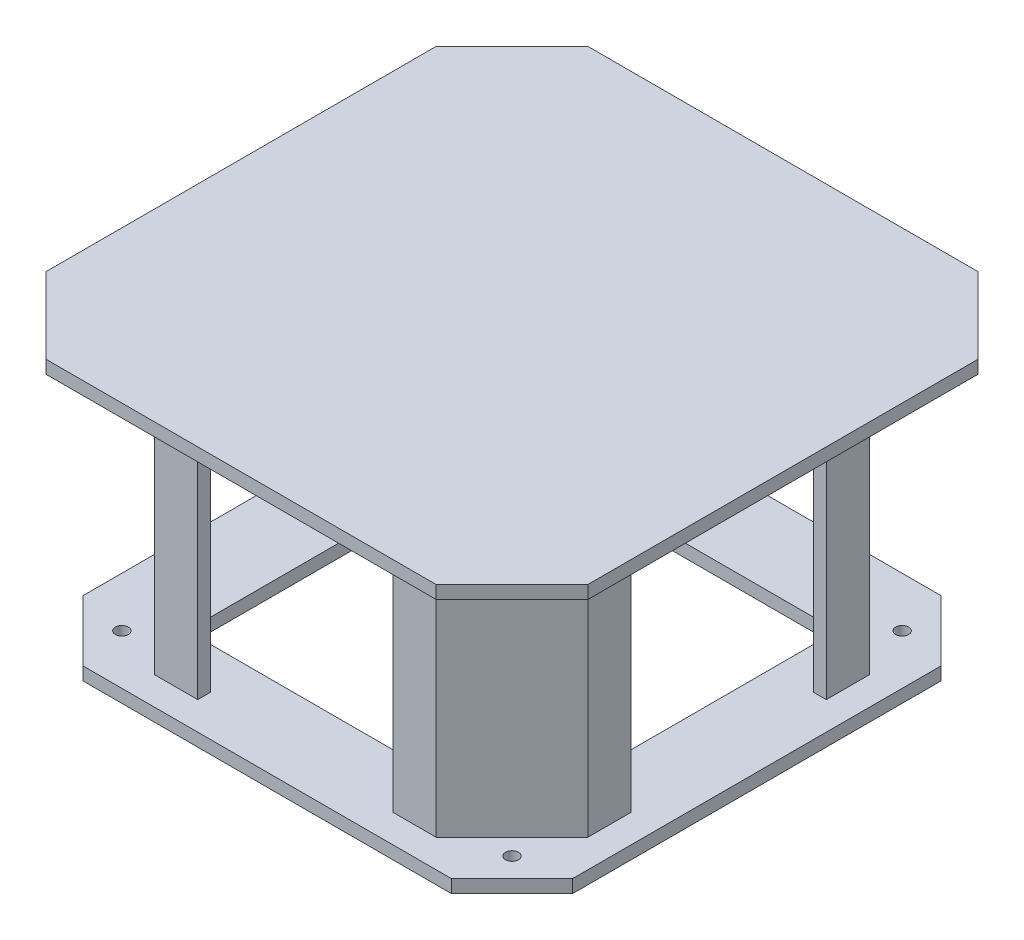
ISO-10303-21;
HEADER;
FILE_DESCRIPTION(('STEP AP214'),'2;1');
FILE_NAME('part.step','',(''),(''),'','','');
FILE_SCHEMA(('AUTOMOTIVE_DESIGN { 1 0 10303 214 1 1 1 1 }'));
ENDSEC;
DATA;
#1=APPLICATION_CONTEXT('core data for automotive mechanical design processes');
#2=APPLICATION_PROTOCOL_DEFINITION('international standard','automotive_design',2000,#1);
#3=PRODUCT_CONTEXT('',#1,'mechanical');
#4=PRODUCT('Part','Part','',(#3));
#5=PRODUCT_RELATED_PRODUCT_CATEGORY('part','',(#4));
#6=PRODUCT_DEFINITION_FORMATION('','',#4);
#7=PRODUCT_DEFINITION_CONTEXT('part definition',#1,'design');
#8=PRODUCT_DEFINITION('design','',#6,#7);
#9=PRODUCT_DEFINITION_SHAPE('','',#8);
#10=(LENGTH_UNIT() NAMED_UNIT(*) SI_UNIT(.MILLI.,.METRE.));
#11=(NAMED_UNIT(*) PLANE_ANGLE_UNIT() SI_UNIT($,.RADIAN.));
#12=(NAMED_UNIT(*) SI_UNIT($,.STERADIAN.) SOLID_ANGLE_UNIT());
#13=UNCERTAINTY_MEASURE_WITH_UNIT(LENGTH_MEASURE(1.E-05),#10,'distance_accuracy_value','');
#14=(GEOMETRIC_REPRESENTATION_CONTEXT(3) GLOBAL_UNCERTAINTY_ASSIGNED_CONTEXT((#13)) GLOBAL_UNIT_ASSIGNED_CONTEXT((#10,
#11,#12)) REPRESENTATION_CONTEXT('',''));
#15=CARTESIAN_POINT('',(0.,0.,0.));
#16=DIRECTION('',(0.,0.,1.));
#17=DIRECTION('',(1.,0.,0.));
#18=AXIS2_PLACEMENT_3D('',#15,#16,#17);
#19=CARTESIAN_POINT('',(0.,0.,0.));
#20=DIRECTION('',(0.,-1.,0.));
#21=DIRECTION('',(0.,0.,-1.));
#22=AXIS2_PLACEMENT_3D('',#19,#20,#21);
#23=PLANE('',#22);
#24=DIRECTION('',(0.707106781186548,0.,0.707106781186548));
#25=VECTOR('',#24,1.);
#26=CARTESIAN_POINT('',(65.,0.,-100.));
#27=LINE('',#26,#25);
#28=CARTESIAN_POINT('',(65.,0.,-100.));
#29=VERTEX_POINT('',#28);
#30=CARTESIAN_POINT('',(100.,0.,-65.));
#31=VERTEX_POINT('',#30);
#32=EDGE_CURVE('E592',#29,#31,#27,.T.);
#33=ORIENTED_EDGE('',*,*,#32,.F.);
#34=DIRECTION('',(1.,0.,0.));
#35=VECTOR('',#34,1.);
#36=CARTESIAN_POINT('',(45.,0.,-100.));
#37=LINE('',#36,#35);
#38=CARTESIAN_POINT('',(45.,0.,-100.));
#39=VERTEX_POINT('',#38);
#40=EDGE_CURVE('E563',#39,#29,#37,.T.);
#41=ORIENTED_EDGE('',*,*,#40,.F.);
#42=DIRECTION('',(0.,0.,-1.));
#43=VECTOR('',#42,1.);
#44=CARTESIAN_POINT('',(45.,0.,-94.));
#45=LINE('',#44,#43);
#46=CARTESIAN_POINT('',(45.,0.,-94.));
#47=VERTEX_POINT('',#46);
#48=EDGE_CURVE('E568',#47,#39,#45,.T.);
#49=ORIENTED_EDGE('',*,*,#48,.F.);
#50=DIRECTION('',(-1.,0.,0.));
#51=VECTOR('',#50,1.);
#52=CARTESIAN_POINT('',(45.,0.,-94.));
#53=LINE('',#52,#51);
#54=CARTESIAN_POINT('',(62.5147186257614,0.,-94.));
#55=VERTEX_POINT('',#54);
#56=EDGE_CURVE('E602',#55,#47,#53,.T.);
#57=ORIENTED_EDGE('',*,*,#56,.F.);
#58=DIRECTION('',(-0.707106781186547,0.,-0.707106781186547));
#59=VECTOR('',#58,1.);
#60=CARTESIAN_POINT('',(62.5147186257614,0.,-94.));
#61=LINE('',#60,#59);
#62=CARTESIAN_POINT('',(94.,0.,-62.5147186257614));
#63=VERTEX_POINT('',#62);
#64=EDGE_CURVE('E600',#63,#55,#61,.T.);
#65=ORIENTED_EDGE('',*,*,#64,.F.);
#66=DIRECTION('',(0.,0.,-1.));
#67=VECTOR('',#66,1.);
#68=CARTESIAN_POINT('',(94.,0.,-62.5147186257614));
#69=LINE('',#68,#67);
#70=CARTESIAN_POINT('',(94.,0.,-45.));
#71=VERTEX_POINT('',#70);
#72=EDGE_CURVE('E598',#71,#63,#69,.T.);
#73=ORIENTED_EDGE('',*,*,#72,.F.);
#74=DIRECTION('',(-1.,0.,0.));
#75=VECTOR('',#74,1.);
#76=CARTESIAN_POINT('',(94.,0.,-45.));
#77=LINE('',#76,#75);
#78=CARTESIAN_POINT('',(100.,0.,-45.));
#79=VERTEX_POINT('',#78);
#80=EDGE_CURVE('E596',#79,#71,#77,.T.);
#81=ORIENTED_EDGE('',*,*,#80,.F.);
#82=DIRECTION('',(0.,0.,1.));
#83=VECTOR('',#82,1.);
#84=CARTESIAN_POINT('',(100.,0.,-65.));
#85=LINE('',#84,#83);
#86=EDGE_CURVE('E594',#31,#79,#85,.T.);
#87=ORIENTED_EDGE('',*,*,#86,.F.);
#88=EDGE_LOOP('',(#33,#41,#49,#57,#65,#73,#81,#87));
#89=FACE_BOUND('',#88,.T.);
#90=DIRECTION('',(0.,0.,1.));
#91=VECTOR('',#90,1.);
#92=CARTESIAN_POINT('',(-94.,0.,45.));
#93=LINE('',#92,#91);
#94=CARTESIAN_POINT('',(-94.,0.,45.));
#95=VERTEX_POINT('',#94);
#96=CARTESIAN_POINT('',(-94.,0.,62.5147186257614));
#97=VERTEX_POINT('',#96);
#98=EDGE_CURVE('E720',#95,#97,#93,.T.);
#99=ORIENTED_EDGE('',*,*,#98,.F.);
#100=DIRECTION('',(1.,0.,0.));
#101=VECTOR('',#100,1.);
#102=CARTESIAN_POINT('',(-100.,0.,45.));
#103=LINE('',#102,#101);
#104=CARTESIAN_POINT('',(-100.,0.,45.));
#105=VERTEX_POINT('',#104);
#106=EDGE_CURVE('E691',#105,#95,#103,.T.);
#107=ORIENTED_EDGE('',*,*,#106,.F.);
#108=DIRECTION('',(0.,0.,-1.));
#109=VECTOR('',#108,1.);
#110=CARTESIAN_POINT('',(-100.,0.,45.));
#111=LINE('',#110,#109);
#112=CARTESIAN_POINT('',(-100.,0.,65.));
#113=VERTEX_POINT('',#112);
#114=EDGE_CURVE('E696',#113,#105,#111,.T.);
#115=ORIENTED_EDGE('',*,*,#114,.F.);
#116=DIRECTION('',(-0.707106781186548,0.,-0.707106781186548));
#117=VECTOR('',#116,1.);
#118=CARTESIAN_POINT('',(-100.,0.,65.));
#119=LINE('',#118,#117);
#120=CARTESIAN_POINT('',(-65.,0.,100.));
#121=VERTEX_POINT('',#120);
#122=EDGE_CURVE('E730',#121,#113,#119,.T.);
#123=ORIENTED_EDGE('',*,*,#122,.F.);
#124=DIRECTION('',(-1.,0.,0.));
#125=VECTOR('',#124,1.);
#126=CARTESIAN_POINT('',(-65.,0.,100.));
#127=LINE('',#126,#125);
#128=CARTESIAN_POINT('',(-45.,0.,100.));
#129=VERTEX_POINT('',#128);
#130=EDGE_CURVE('E728',#129,#121,#127,.T.);
#131=ORIENTED_EDGE('',*,*,#130,.F.);
#132=DIRECTION('',(0.,0.,1.));
#133=VECTOR('',#132,1.);
#134=CARTESIAN_POINT('',(-45.,0.,100.));
#135=LINE('',#134,#133);
#136=CARTESIAN_POINT('',(-45.,0.,94.));
#137=VERTEX_POINT('',#136);
#138=EDGE_CURVE('E726',#137,#129,#135,.T.);
#139=ORIENTED_EDGE('',*,*,#138,.F.);
#140=DIRECTION('',(1.,0.,0.));
#141=VECTOR('',#140,1.);
#142=CARTESIAN_POINT('',(-62.5147186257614,0.,94.));
#143=LINE('',#142,#141);
#144=CARTESIAN_POINT('',(-62.5147186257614,0.,94.));
#145=VERTEX_POINT('',#144);
#146=EDGE_CURVE('E724',#145,#137,#143,.T.);
#147=ORIENTED_EDGE('',*,*,#146,.F.);
#148=DIRECTION('',(0.707106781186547,0.,0.707106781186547));
#149=VECTOR('',#148,1.);
#150=CARTESIAN_POINT('',(-94.,0.,62.5147186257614));
#151=LINE('',#150,#149);
#152=EDGE_CURVE('E722',#97,#145,#151,.T.);
#153=ORIENTED_EDGE('',*,*,#152,.F.);
#154=EDGE_LOOP('',(#99,#107,#115,#123,#131,#139,#147,#153));
#155=FACE_BOUND('',#154,.T.);
#156=DIRECTION('',(0.,0.,1.));
#157=VECTOR('',#156,1.);
#158=CARTESIAN_POINT('',(-125.,0.,125.));
#159=LINE('',#158,#157);
#160=CARTESIAN_POINT('',(-125.,0.,-89.9999999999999));
#161=VERTEX_POINT('',#160);
#162=CARTESIAN_POINT('',(-125.,0.,89.9999999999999));
#163=VERTEX_POINT('',#162);
#164=EDGE_CURVE('E775',#161,#163,#159,.T.);
#165=ORIENTED_EDGE('',*,*,#164,.F.);
#166=DIRECTION('',(-0.707106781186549,0.,0.707106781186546));
#167=VECTOR('',#166,1.);
#168=CARTESIAN_POINT('',(-107.5,0.,-107.5));
#169=LINE('',#168,#167);
#170=CARTESIAN_POINT('',(-89.9999999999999,0.,-125.));
#171=VERTEX_POINT('',#170);
#172=EDGE_CURVE('E790',#161,#171,#169,.F.);
#173=ORIENTED_EDGE('',*,*,#172,.T.);
#174=DIRECTION('',(-1.,0.,0.));
#175=VECTOR('',#174,1.);
#176=CARTESIAN_POINT('',(-125.,0.,-125.));
#177=LINE('',#176,#175);
#178=CARTESIAN_POINT('',(90.,0.,-125.));
#179=VERTEX_POINT('',#178);
#180=EDGE_CURVE('E772',#179,#171,#177,.T.);
#181=ORIENTED_EDGE('',*,*,#180,.F.);
#182=DIRECTION('',(-0.707106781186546,0.,-0.707106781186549));
#183=VECTOR('',#182,1.);
#184=CARTESIAN_POINT('',(107.5,0.,-107.5));
#185=LINE('',#184,#183);
#186=CARTESIAN_POINT('',(125.,0.,-89.9999999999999));
#187=VERTEX_POINT('',#186);
#188=EDGE_CURVE('E788',#179,#187,#185,.F.);
#189=ORIENTED_EDGE('',*,*,#188,.T.);
#190=DIRECTION('',(0.,0.,-1.));
#191=VECTOR('',#190,1.);
#192=CARTESIAN_POINT('',(125.,0.,125.));
#193=LINE('',#192,#191);
#194=CARTESIAN_POINT('',(125.,0.,90.0000000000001));
#195=VERTEX_POINT('',#194);
#196=EDGE_CURVE('E755',#195,#187,#193,.T.);
#197=ORIENTED_EDGE('',*,*,#196,.F.);
#198=DIRECTION('',(0.707106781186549,0.,-0.707106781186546));
#199=VECTOR('',#198,1.);
#200=CARTESIAN_POINT('',(107.5,0.,107.5));
#201=LINE('',#200,#199);
#202=CARTESIAN_POINT('',(89.9999999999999,0.,125.));
#203=VERTEX_POINT('',#202);
#204=EDGE_CURVE('E786',#195,#203,#201,.F.);
#205=ORIENTED_EDGE('',*,*,#204,.T.);
#206=DIRECTION('',(1.,0.,0.));
#207=VECTOR('',#206,1.);
#208=CARTESIAN_POINT('',(-125.,0.,125.));
#209=LINE('',#208,#207);
#210=CARTESIAN_POINT('',(-90.0000000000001,0.,125.));
#211=VERTEX_POINT('',#210);
#212=EDGE_CURVE('E760',#211,#203,#209,.T.);
#213=ORIENTED_EDGE('',*,*,#212,.F.);
#214=DIRECTION('',(0.707106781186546,0.,0.707106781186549));
#215=VECTOR('',#214,1.);
#216=CARTESIAN_POINT('',(-107.5,0.,107.5));
#217=LINE('',#216,#215);
#218=EDGE_CURVE('E784',#211,#163,#217,.F.);
#219=ORIENTED_EDGE('',*,*,#218,.T.);
#220=EDGE_LOOP('',(#165,#173,#181,#189,#197,#205,#213,#219));
#221=FACE_BOUND('',#220,.T.);
#222=DIRECTION('',(1.,0.,0.));
#223=VECTOR('',#222,1.);
#224=CARTESIAN_POINT('',(-65.,0.,-100.));
#225=LINE('',#224,#223);
#226=CARTESIAN_POINT('',(-65.,0.,-100.));
#227=VERTEX_POINT('',#226);
#228=CARTESIAN_POINT('',(-45.,0.,-100.));
#229=VERTEX_POINT('',#228);
#230=EDGE_CURVE('E656',#227,#229,#225,.T.);
#231=ORIENTED_EDGE('',*,*,#230,.F.);
#232=DIRECTION('',(0.707106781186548,0.,-0.707106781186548));
#233=VECTOR('',#232,1.);
#234=CARTESIAN_POINT('',(-100.,0.,-65.));
#235=LINE('',#234,#233);
#236=CARTESIAN_POINT('',(-100.,0.,-65.));
#237=VERTEX_POINT('',#236);
#238=EDGE_CURVE('E627',#237,#227,#235,.T.);
#239=ORIENTED_EDGE('',*,*,#238,.F.);
#240=DIRECTION('',(0.,0.,-1.));
#241=VECTOR('',#240,1.);
#242=CARTESIAN_POINT('',(-100.,0.,-65.));
#243=LINE('',#242,#241);
#244=CARTESIAN_POINT('',(-100.,0.,-45.));
#245=VERTEX_POINT('',#244);
#246=EDGE_CURVE('E632',#245,#237,#243,.T.);
#247=ORIENTED_EDGE('',*,*,#246,.F.);
#248=DIRECTION('',(-1.,0.,0.));
#249=VECTOR('',#248,1.);
#250=CARTESIAN_POINT('',(-100.,0.,-45.));
#251=LINE('',#250,#249);
#252=CARTESIAN_POINT('',(-94.,0.,-45.));
#253=VERTEX_POINT('',#252);
#254=EDGE_CURVE('E666',#253,#245,#251,.T.);
#255=ORIENTED_EDGE('',*,*,#254,.F.);
#256=DIRECTION('',(0.,0.,1.));
#257=VECTOR('',#256,1.);
#258=CARTESIAN_POINT('',(-94.,0.,-62.5147186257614));
#259=LINE('',#258,#257);
#260=CARTESIAN_POINT('',(-94.,0.,-62.5147186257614));
#261=VERTEX_POINT('',#260);
#262=EDGE_CURVE('E664',#261,#253,#259,.T.);
#263=ORIENTED_EDGE('',*,*,#262,.F.);
#264=DIRECTION('',(-0.707106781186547,0.,0.707106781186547));
#265=VECTOR('',#264,1.);
#266=CARTESIAN_POINT('',(-94.,0.,-62.5147186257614));
#267=LINE('',#266,#265);
#268=CARTESIAN_POINT('',(-62.5147186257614,0.,-94.));
#269=VERTEX_POINT('',#268);
#270=EDGE_CURVE('E662',#269,#261,#267,.T.);
#271=ORIENTED_EDGE('',*,*,#270,.F.);
#272=DIRECTION('',(-1.,0.,0.));
#273=VECTOR('',#272,1.);
#274=CARTESIAN_POINT('',(-62.5147186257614,0.,-94.));
#275=LINE('',#274,#273);
#276=CARTESIAN_POINT('',(-45.,0.,-94.));
#277=VERTEX_POINT('',#276);
#278=EDGE_CURVE('E660',#277,#269,#275,.T.);
#279=ORIENTED_EDGE('',*,*,#278,.F.);
#280=DIRECTION('',(0.,0.,1.));
#281=VECTOR('',#280,1.);
#282=CARTESIAN_POINT('',(-45.,0.,-100.));
#283=LINE('',#282,#281);
#284=EDGE_CURVE('E658',#229,#277,#283,.T.);
#285=ORIENTED_EDGE('',*,*,#284,.F.);
#286=EDGE_LOOP('',(#231,#239,#247,#255,#263,#271,#279,#285));
#287=FACE_BOUND('',#286,.T.);
#288=DIRECTION('',(0.,0.,-1.));
#289=VECTOR('',#288,1.);
#290=CARTESIAN_POINT('',(45.,0.,100.));
#291=LINE('',#290,#289);
#292=CARTESIAN_POINT('',(45.,0.,100.));
#293=VERTEX_POINT('',#292);
#294=CARTESIAN_POINT('',(45.,0.,94.));
#295=VERTEX_POINT('',#294);
#296=EDGE_CURVE('E528',#293,#295,#291,.T.);
#297=ORIENTED_EDGE('',*,*,#296,.F.);
#298=DIRECTION('',(-1.,0.,0.));
#299=VECTOR('',#298,1.);
#300=CARTESIAN_POINT('',(45.,0.,100.));
#301=LINE('',#300,#299);
#302=CARTESIAN_POINT('',(65.,0.,100.));
#303=VERTEX_POINT('',#302);
#304=EDGE_CURVE('E499',#303,#293,#301,.T.);
#305=ORIENTED_EDGE('',*,*,#304,.F.);
#306=DIRECTION('',(-0.707106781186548,0.,0.707106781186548));
#307=VECTOR('',#306,1.);
#308=CARTESIAN_POINT('',(65.,0.,100.));
#309=LINE('',#308,#307);
#310=CARTESIAN_POINT('',(100.,0.,65.));
#311=VERTEX_POINT('',#310);
#312=EDGE_CURVE('E504',#311,#303,#309,.T.);
#313=ORIENTED_EDGE('',*,*,#312,.F.);
#314=DIRECTION('',(0.,0.,1.));
#315=VECTOR('',#314,1.);
#316=CARTESIAN_POINT('',(100.,0.,45.));
#317=LINE('',#316,#315);
#318=CARTESIAN_POINT('',(100.,0.,45.));
#319=VERTEX_POINT('',#318);
#320=EDGE_CURVE('E538',#319,#311,#317,.T.);
#321=ORIENTED_EDGE('',*,*,#320,.F.);
#322=DIRECTION('',(1.,0.,0.));
#323=VECTOR('',#322,1.);
#324=CARTESIAN_POINT('',(94.,0.,45.));
#325=LINE('',#324,#323);
#326=CARTESIAN_POINT('',(94.,0.,45.));
#327=VERTEX_POINT('',#326);
#328=EDGE_CURVE('E536',#327,#319,#325,.T.);
#329=ORIENTED_EDGE('',*,*,#328,.F.);
#330=DIRECTION('',(0.,0.,-1.));
#331=VECTOR('',#330,1.);
#332=CARTESIAN_POINT('',(94.,0.,45.));
#333=LINE('',#332,#331);
#334=CARTESIAN_POINT('',(94.,0.,62.5147186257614));
#335=VERTEX_POINT('',#334);
#336=EDGE_CURVE('E534',#335,#327,#333,.T.);
#337=ORIENTED_EDGE('',*,*,#336,.F.);
#338=DIRECTION('',(0.707106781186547,0.,-0.707106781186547));
#339=VECTOR('',#338,1.);
#340=CARTESIAN_POINT('',(62.5147186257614,0.,94.));
#341=LINE('',#340,#339);
#342=CARTESIAN_POINT('',(62.5147186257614,0.,94.));
#343=VERTEX_POINT('',#342);
#344=EDGE_CURVE('E532',#343,#335,#341,.T.);
#345=ORIENTED_EDGE('',*,*,#344,.F.);
#346=DIRECTION('',(1.,0.,0.));
#347=VECTOR('',#346,1.);
#348=CARTESIAN_POINT('',(45.,0.,94.));
#349=LINE('',#348,#347);
#350=EDGE_CURVE('E530',#295,#343,#349,.T.);
#351=ORIENTED_EDGE('',*,*,#350,.F.);
#352=EDGE_LOOP('',(#297,#305,#313,#321,#329,#337,#345,#351));
#353=FACE_BOUND('',#352,.T.);
#354=ADVANCED_FACE('F40',(#89,#155,#221,#287,#353),#23,.T.);
#355=CARTESIAN_POINT('',(125.,6.,125.));
#356=DIRECTION('',(-1.,0.,0.));
#357=DIRECTION('',(0.,0.,1.));
#358=AXIS2_PLACEMENT_3D('',#355,#356,#357);
#359=PLANE('',#358);
#360=ORIENTED_EDGE('',*,*,#196,.T.);
#361=DIRECTION('',(0.,1.,0.));
#362=VECTOR('',#361,1.);
#363=CARTESIAN_POINT('',(125.,6.,-89.9999999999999));
#364=LINE('',#363,#362);
#365=CARTESIAN_POINT('',(125.,6.,-89.9999999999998));
#366=VERTEX_POINT('',#365);
#367=EDGE_CURVE('E808',#187,#366,#364,.T.);
#368=ORIENTED_EDGE('',*,*,#367,.T.);
#369=DIRECTION('',(0.,0.,-1.));
#370=VECTOR('',#369,1.);
#371=CARTESIAN_POINT('',(125.,6.,125.));
#372=LINE('',#371,#370);
#373=CARTESIAN_POINT('',(125.,6.,90.0000000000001));
#374=VERTEX_POINT('',#373);
#375=EDGE_CURVE('E756',#374,#366,#372,.T.);
#376=ORIENTED_EDGE('',*,*,#375,.F.);
#377=DIRECTION('',(0.,-1.,0.));
#378=VECTOR('',#377,1.);
#379=CARTESIAN_POINT('',(125.,6.,90.0000000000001));
#380=LINE('',#379,#378);
#381=EDGE_CURVE('E805',#374,#195,#380,.T.);
#382=ORIENTED_EDGE('',*,*,#381,.T.);
#383=EDGE_LOOP('',(#360,#368,#376,#382));
#384=FACE_BOUND('',#383,.T.);
#385=ADVANCED_FACE('F828',(#384),#359,.F.);
#386=CARTESIAN_POINT('',(-125.,6.,-125.));
#387=DIRECTION('',(0.,0.,1.));
#388=DIRECTION('',(1.,0.,0.));
#389=AXIS2_PLACEMENT_3D('',#386,#387,#388);
#390=PLANE('',#389);
#391=ORIENTED_EDGE('',*,*,#180,.T.);
#392=DIRECTION('',(0.,1.,0.));
#393=VECTOR('',#392,1.);
#394=CARTESIAN_POINT('',(-89.9999999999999,6.,-125.));
#395=LINE('',#394,#393);
#396=CARTESIAN_POINT('',(-89.9999999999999,6.,-125.));
#397=VERTEX_POINT('',#396);
#398=EDGE_CURVE('E795',#171,#397,#395,.T.);
#399=ORIENTED_EDGE('',*,*,#398,.T.);
#400=DIRECTION('',(-1.,0.,0.));
#401=VECTOR('',#400,1.);
#402=CARTESIAN_POINT('',(-125.,6.,-125.));
#403=LINE('',#402,#401);
#404=CARTESIAN_POINT('',(90.,6.,-125.));
#405=VERTEX_POINT('',#404);
#406=EDGE_CURVE('E759',#405,#397,#403,.T.);
#407=ORIENTED_EDGE('',*,*,#406,.F.);
#408=DIRECTION('',(0.,-1.,0.));
#409=VECTOR('',#408,1.);
#410=CARTESIAN_POINT('',(90.0000000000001,6.,-125.));
#411=LINE('',#410,#409);
#412=EDGE_CURVE('E792',#405,#179,#411,.T.);
#413=ORIENTED_EDGE('',*,*,#412,.T.);
#414=EDGE_LOOP('',(#391,#399,#407,#413));
#415=FACE_BOUND('',#414,.T.);
#416=ADVANCED_FACE('F839',(#415),#390,.F.);
#417=CARTESIAN_POINT('',(-125.,6.,125.));
#418=DIRECTION('',(1.,0.,0.));
#419=DIRECTION('',(0.,0.,-1.));
#420=AXIS2_PLACEMENT_3D('',#417,#418,#419);
#421=PLANE('',#420);
#422=DIRECTION('',(0.,0.,1.));
#423=VECTOR('',#422,1.);
#424=CARTESIAN_POINT('',(-125.,6.,125.));
#425=LINE('',#424,#423);
#426=CARTESIAN_POINT('',(-125.,6.,-90.));
#427=VERTEX_POINT('',#426);
#428=CARTESIAN_POINT('',(-125.,6.,89.9999999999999));
#429=VERTEX_POINT('',#428);
#430=EDGE_CURVE('E763',#427,#429,#425,.T.);
#431=ORIENTED_EDGE('',*,*,#430,.F.);
#432=DIRECTION('',(0.,-1.,0.));
#433=VECTOR('',#432,1.);
#434=CARTESIAN_POINT('',(-125.,6.,-90.0000000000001));
#435=LINE('',#434,#433);
#436=EDGE_CURVE('E781',#427,#161,#435,.T.);
#437=ORIENTED_EDGE('',*,*,#436,.T.);
#438=ORIENTED_EDGE('',*,*,#164,.T.);
#439=DIRECTION('',(0.,1.,0.));
#440=VECTOR('',#439,1.);
#441=CARTESIAN_POINT('',(-125.,6.,89.9999999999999));
#442=LINE('',#441,#440);
#443=EDGE_CURVE('E769',#163,#429,#442,.T.);
#444=ORIENTED_EDGE('',*,*,#443,.T.);
#445=EDGE_LOOP('',(#431,#437,#438,#444));
#446=FACE_BOUND('',#445,.T.);
#447=ADVANCED_FACE('F847',(#446),#421,.F.);
#448=CARTESIAN_POINT('',(-125.,6.,125.));
#449=DIRECTION('',(0.,0.,-1.));
#450=DIRECTION('',(-1.,0.,0.));
#451=AXIS2_PLACEMENT_3D('',#448,#449,#450);
#452=PLANE('',#451);
#453=ORIENTED_EDGE('',*,*,#212,.T.);
#454=DIRECTION('',(0.,1.,0.));
#455=VECTOR('',#454,1.);
#456=CARTESIAN_POINT('',(89.9999999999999,6.,125.));
#457=LINE('',#456,#455);
#458=CARTESIAN_POINT('',(89.9999999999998,6.,125.));
#459=VERTEX_POINT('',#458);
#460=EDGE_CURVE('E11',#203,#459,#457,.T.);
#461=ORIENTED_EDGE('',*,*,#460,.T.);
#462=DIRECTION('',(1.,0.,0.));
#463=VECTOR('',#462,1.);
#464=CARTESIAN_POINT('',(-125.,6.,125.));
#465=LINE('',#464,#463);
#466=CARTESIAN_POINT('',(-90.0000000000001,6.,125.));
#467=VERTEX_POINT('',#466);
#468=EDGE_CURVE('E766',#467,#459,#465,.T.);
#469=ORIENTED_EDGE('',*,*,#468,.F.);
#470=DIRECTION('',(0.,-1.,0.));
#471=VECTOR('',#470,1.);
#472=CARTESIAN_POINT('',(-90.0000000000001,6.,125.));
#473=LINE('',#472,#471);
#474=EDGE_CURVE('E48',#467,#211,#473,.T.);
#475=ORIENTED_EDGE('',*,*,#474,.T.);
#476=EDGE_LOOP('',(#453,#461,#469,#475));
#477=FACE_BOUND('',#476,.T.);
#478=ADVANCED_FACE('F814',(#477),#452,.F.);
#479=CARTESIAN_POINT('',(0.,6.,0.));
#480=DIRECTION('',(0.,-1.,0.));
#481=DIRECTION('',(0.,0.,-1.));
#482=AXIS2_PLACEMENT_3D('',#479,#480,#481);
#483=PLANE('',#482);
#484=ORIENTED_EDGE('',*,*,#406,.T.);
#485=DIRECTION('',(0.707106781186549,0.,-0.707106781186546));
#486=VECTOR('',#485,1.);
#487=CARTESIAN_POINT('',(-125.,6.,-90.0000000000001));
#488=LINE('',#487,#486);
#489=EDGE_CURVE('E803',#397,#427,#488,.F.);
#490=ORIENTED_EDGE('',*,*,#489,.T.);
#491=ORIENTED_EDGE('',*,*,#430,.T.);
#492=DIRECTION('',(-0.707106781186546,0.,-0.707106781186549));
#493=VECTOR('',#492,1.);
#494=CARTESIAN_POINT('',(-90.0000000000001,6.,125.));
#495=LINE('',#494,#493);
#496=EDGE_CURVE('E797',#429,#467,#495,.F.);
#497=ORIENTED_EDGE('',*,*,#496,.T.);
#498=ORIENTED_EDGE('',*,*,#468,.T.);
#499=DIRECTION('',(-0.707106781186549,0.,0.707106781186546));
#500=VECTOR('',#499,1.);
#501=CARTESIAN_POINT('',(125.,6.,90.0000000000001));
#502=LINE('',#501,#500);
#503=EDGE_CURVE('E799',#459,#374,#502,.F.);
#504=ORIENTED_EDGE('',*,*,#503,.T.);
#505=ORIENTED_EDGE('',*,*,#375,.T.);
#506=DIRECTION('',(0.707106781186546,0.,0.707106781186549));
#507=VECTOR('',#506,1.);
#508=CARTESIAN_POINT('',(90.0000000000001,6.,-125.));
#509=LINE('',#508,#507);
#510=EDGE_CURVE('E801',#366,#405,#509,.F.);
#511=ORIENTED_EDGE('',*,*,#510,.T.);
#512=EDGE_LOOP('',(#484,#490,#491,#497,#498,#504,#505,#511));
#513=FACE_BOUND('',#512,.T.);
#514=ADVANCED_FACE('F832',(#513),#483,.F.);
#515=CARTESIAN_POINT('',(-125.,6.,-90.0000000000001));
#516=DIRECTION('',(0.707106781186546,0.,0.707106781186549));
#517=DIRECTION('',(0.,-1.,0.));
#518=AXIS2_PLACEMENT_3D('',#515,#516,#517);
#519=PLANE('',#518);
#520=ORIENTED_EDGE('',*,*,#489,.F.);
#521=ORIENTED_EDGE('',*,*,#398,.F.);
#522=ORIENTED_EDGE('',*,*,#172,.F.);
#523=ORIENTED_EDGE('',*,*,#436,.F.);
#524=EDGE_LOOP('',(#520,#521,#522,#523));
#525=FACE_BOUND('',#524,.T.);
#526=ADVANCED_FACE('F844',(#525),#519,.F.);
#527=CARTESIAN_POINT('',(90.0000000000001,6.,-125.));
#528=DIRECTION('',(-0.707106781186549,0.,0.707106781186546));
#529=DIRECTION('',(0.,-1.,0.));
#530=AXIS2_PLACEMENT_3D('',#527,#528,#529);
#531=PLANE('',#530);
#532=ORIENTED_EDGE('',*,*,#510,.F.);
#533=ORIENTED_EDGE('',*,*,#367,.F.);
#534=ORIENTED_EDGE('',*,*,#188,.F.);
#535=ORIENTED_EDGE('',*,*,#412,.F.);
#536=EDGE_LOOP('',(#532,#533,#534,#535));
#537=FACE_BOUND('',#536,.T.);
#538=ADVANCED_FACE('F836',(#537),#531,.F.);
#539=CARTESIAN_POINT('',(125.,6.,90.0000000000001));
#540=DIRECTION('',(-0.707106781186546,0.,-0.707106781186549));
#541=DIRECTION('',(0.,-1.,0.));
#542=AXIS2_PLACEMENT_3D('',#539,#540,#541);
#543=PLANE('',#542);
#544=ORIENTED_EDGE('',*,*,#503,.F.);
#545=ORIENTED_EDGE('',*,*,#460,.F.);
#546=ORIENTED_EDGE('',*,*,#204,.F.);
#547=ORIENTED_EDGE('',*,*,#381,.F.);
#548=EDGE_LOOP('',(#544,#545,#546,#547));
#549=FACE_BOUND('',#548,.T.);
#550=ADVANCED_FACE('F825',(#549),#543,.F.);
#551=CARTESIAN_POINT('',(-90.0000000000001,6.,125.));
#552=DIRECTION('',(0.707106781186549,0.,-0.707106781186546));
#553=DIRECTION('',(0.,-1.,0.));
#554=AXIS2_PLACEMENT_3D('',#551,#552,#553);
#555=PLANE('',#554);
#556=ORIENTED_EDGE('',*,*,#496,.F.);
#557=ORIENTED_EDGE('',*,*,#443,.F.);
#558=ORIENTED_EDGE('',*,*,#218,.F.);
#559=ORIENTED_EDGE('',*,*,#474,.F.);
#560=EDGE_LOOP('',(#556,#557,#558,#559));
#561=FACE_BOUND('',#560,.T.);
#562=ADVANCED_FACE('F42',(#561),#555,.F.);
#563=CARTESIAN_POINT('',(-100.,-120.,45.));
#564=DIRECTION('',(0.,0.,1.));
#565=DIRECTION('',(1.,0.,0.));
#566=AXIS2_PLACEMENT_3D('',#563,#564,#565);
#567=PLANE('',#566);
#568=ORIENTED_EDGE('',*,*,#106,.T.);
#569=DIRECTION('',(0.,1.,0.));
#570=VECTOR('',#569,1.);
#571=CARTESIAN_POINT('',(-94.,-120.,45.));
#572=LINE('',#571,#570);
#573=CARTESIAN_POINT('',(-94.,-120.,45.));
#574=VERTEX_POINT('',#573);
#575=EDGE_CURVE('E753',#574,#95,#572,.T.);
#576=ORIENTED_EDGE('',*,*,#575,.F.);
#577=DIRECTION('',(1.,0.,0.));
#578=VECTOR('',#577,1.);
#579=CARTESIAN_POINT('',(-100.,-120.,45.));
#580=LINE('',#579,#578);
#581=CARTESIAN_POINT('',(-100.,-120.,45.));
#582=VERTEX_POINT('',#581);
#583=EDGE_CURVE('E692',#582,#574,#580,.T.);
#584=ORIENTED_EDGE('',*,*,#583,.F.);
#585=DIRECTION('',(0.,1.,0.));
#586=VECTOR('',#585,1.);
#587=CARTESIAN_POINT('',(-100.,-120.,45.));
#588=LINE('',#587,#586);
#589=EDGE_CURVE('E717',#582,#105,#588,.T.);
#590=ORIENTED_EDGE('',*,*,#589,.T.);
#591=EDGE_LOOP('',(#568,#576,#584,#590));
#592=FACE_BOUND('',#591,.T.);
#593=ADVANCED_FACE('F850',(#592),#567,.F.);
#594=CARTESIAN_POINT('',(-94.,-120.,45.));
#595=DIRECTION('',(-1.,0.,0.));
#596=DIRECTION('',(0.,0.,1.));
#597=AXIS2_PLACEMENT_3D('',#594,#595,#596);
#598=PLANE('',#597);
#599=ORIENTED_EDGE('',*,*,#98,.T.);
#600=DIRECTION('',(0.,1.,0.));
#601=VECTOR('',#600,1.);
#602=CARTESIAN_POINT('',(-94.,-120.,62.5147186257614));
#603=LINE('',#602,#601);
#604=CARTESIAN_POINT('',(-94.,-120.,62.5147186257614));
#605=VERTEX_POINT('',#604);
#606=EDGE_CURVE('E750',#605,#97,#603,.T.);
#607=ORIENTED_EDGE('',*,*,#606,.F.);
#608=DIRECTION('',(0.,0.,1.));
#609=VECTOR('',#608,1.);
#610=CARTESIAN_POINT('',(-94.,-120.,45.));
#611=LINE('',#610,#609);
#612=EDGE_CURVE('E695',#574,#605,#611,.T.);
#613=ORIENTED_EDGE('',*,*,#612,.F.);
#614=ORIENTED_EDGE('',*,*,#575,.T.);
#615=EDGE_LOOP('',(#599,#607,#613,#614));
#616=FACE_BOUND('',#615,.T.);
#617=ADVANCED_FACE('F855',(#616),#598,.F.);
#618=CARTESIAN_POINT('',(-94.,-120.,62.5147186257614));
#619=DIRECTION('',(-0.707106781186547,0.,0.707106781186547));
#620=DIRECTION('',(0.707106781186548,0.,0.707106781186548));
#621=AXIS2_PLACEMENT_3D('',#618,#619,#620);
#622=PLANE('',#621);
#623=ORIENTED_EDGE('',*,*,#152,.T.);
#624=DIRECTION('',(0.,1.,0.));
#625=VECTOR('',#624,1.);
#626=CARTESIAN_POINT('',(-62.5147186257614,-120.,94.));
#627=LINE('',#626,#625);
#628=CARTESIAN_POINT('',(-62.5147186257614,-120.,94.));
#629=VERTEX_POINT('',#628);
#630=EDGE_CURVE('E747',#629,#145,#627,.T.);
#631=ORIENTED_EDGE('',*,*,#630,.F.);
#632=DIRECTION('',(0.707106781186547,0.,0.707106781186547));
#633=VECTOR('',#632,1.);
#634=CARTESIAN_POINT('',(-94.,-120.,62.5147186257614));
#635=LINE('',#634,#633);
#636=EDGE_CURVE('E699',#605,#629,#635,.T.);
#637=ORIENTED_EDGE('',*,*,#636,.F.);
#638=ORIENTED_EDGE('',*,*,#606,.T.);
#639=EDGE_LOOP('',(#623,#631,#637,#638));
#640=FACE_BOUND('',#639,.T.);
#641=ADVANCED_FACE('F901',(#640),#622,.F.);
#642=CARTESIAN_POINT('',(-62.5147186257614,-120.,94.));
#643=DIRECTION('',(0.,0.,1.));
#644=DIRECTION('',(1.,0.,0.));
#645=AXIS2_PLACEMENT_3D('',#642,#643,#644);
#646=PLANE('',#645);
#647=ORIENTED_EDGE('',*,*,#146,.T.);
#648=DIRECTION('',(0.,1.,0.));
#649=VECTOR('',#648,1.);
#650=CARTESIAN_POINT('',(-45.,-120.,94.));
#651=LINE('',#650,#649);
#652=CARTESIAN_POINT('',(-45.,-120.,94.));
#653=VERTEX_POINT('',#652);
#654=EDGE_CURVE('E744',#653,#137,#651,.T.);
#655=ORIENTED_EDGE('',*,*,#654,.F.);
#656=DIRECTION('',(1.,0.,0.));
#657=VECTOR('',#656,1.);
#658=CARTESIAN_POINT('',(-62.5147186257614,-120.,94.));
#659=LINE('',#658,#657);
#660=EDGE_CURVE('E702',#629,#653,#659,.T.);
#661=ORIENTED_EDGE('',*,*,#660,.F.);
#662=ORIENTED_EDGE('',*,*,#630,.T.);
#663=EDGE_LOOP('',(#647,#655,#661,#662));
#664=FACE_BOUND('',#663,.T.);
#665=ADVANCED_FACE('F910',(#664),#646,.F.);
#666=CARTESIAN_POINT('',(-45.,-120.,100.));
#667=DIRECTION('',(-1.,0.,0.));
#668=DIRECTION('',(0.,0.,1.));
#669=AXIS2_PLACEMENT_3D('',#666,#667,#668);
#670=PLANE('',#669);
#671=ORIENTED_EDGE('',*,*,#138,.T.);
#672=DIRECTION('',(0.,1.,0.));
#673=VECTOR('',#672,1.);
#674=CARTESIAN_POINT('',(-45.,-120.,100.));
#675=LINE('',#674,#673);
#676=CARTESIAN_POINT('',(-45.,-120.,100.));
#677=VERTEX_POINT('',#676);
#678=EDGE_CURVE('E741',#677,#129,#675,.T.);
#679=ORIENTED_EDGE('',*,*,#678,.F.);
#680=DIRECTION('',(0.,0.,1.));
#681=VECTOR('',#680,1.);
#682=CARTESIAN_POINT('',(-45.,-120.,100.));
#683=LINE('',#682,#681);
#684=EDGE_CURVE('E705',#653,#677,#683,.T.);
#685=ORIENTED_EDGE('',*,*,#684,.F.);
#686=ORIENTED_EDGE('',*,*,#654,.T.);
#687=EDGE_LOOP('',(#671,#679,#685,#686));
#688=FACE_BOUND('',#687,.T.);
#689=ADVANCED_FACE('F919',(#688),#670,.F.);
#690=CARTESIAN_POINT('',(-65.,-120.,100.));
#691=DIRECTION('',(0.,0.,-1.));
#692=DIRECTION('',(-1.,0.,0.));
#693=AXIS2_PLACEMENT_3D('',#690,#691,#692);
#694=PLANE('',#693);
#695=ORIENTED_EDGE('',*,*,#130,.T.);
#696=DIRECTION('',(0.,1.,0.));
#697=VECTOR('',#696,1.);
#698=CARTESIAN_POINT('',(-65.,-120.,100.));
#699=LINE('',#698,#697);
#700=CARTESIAN_POINT('',(-65.,-120.,100.));
#701=VERTEX_POINT('',#700);
#702=EDGE_CURVE('E738',#701,#121,#699,.T.);
#703=ORIENTED_EDGE('',*,*,#702,.F.);
#704=DIRECTION('',(-1.,0.,0.));
#705=VECTOR('',#704,1.);
#706=CARTESIAN_POINT('',(-65.,-120.,100.));
#707=LINE('',#706,#705);
#708=EDGE_CURVE('E708',#677,#701,#707,.T.);
#709=ORIENTED_EDGE('',*,*,#708,.F.);
#710=ORIENTED_EDGE('',*,*,#678,.T.);
#711=EDGE_LOOP('',(#695,#703,#709,#710));
#712=FACE_BOUND('',#711,.T.);
#713=ADVANCED_FACE('F928',(#712),#694,.F.);
#714=CARTESIAN_POINT('',(-100.,-120.,65.));
#715=DIRECTION('',(0.707106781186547,0.,-0.707106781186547));
#716=DIRECTION('',(-0.707106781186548,0.,-0.707106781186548));
#717=AXIS2_PLACEMENT_3D('',#714,#715,#716);
#718=PLANE('',#717);
#719=ORIENTED_EDGE('',*,*,#122,.T.);
#720=DIRECTION('',(0.,1.,0.));
#721=VECTOR('',#720,1.);
#722=CARTESIAN_POINT('',(-100.,-120.,65.));
#723=LINE('',#722,#721);
#724=CARTESIAN_POINT('',(-100.,-120.,65.));
#725=VERTEX_POINT('',#724);
#726=EDGE_CURVE('E736',#725,#113,#723,.T.);
#727=ORIENTED_EDGE('',*,*,#726,.F.);
#728=DIRECTION('',(-0.707106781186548,0.,-0.707106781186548));
#729=VECTOR('',#728,1.);
#730=CARTESIAN_POINT('',(-100.,-120.,65.));
#731=LINE('',#730,#729);
#732=EDGE_CURVE('E711',#701,#725,#731,.T.);
#733=ORIENTED_EDGE('',*,*,#732,.F.);
#734=ORIENTED_EDGE('',*,*,#702,.T.);
#735=EDGE_LOOP('',(#719,#727,#733,#734));
#736=FACE_BOUND('',#735,.T.);
#737=ADVANCED_FACE('F937',(#736),#718,.F.);
#738=CARTESIAN_POINT('',(-100.,-120.,45.));
#739=DIRECTION('',(1.,0.,0.));
#740=DIRECTION('',(0.,0.,-1.));
#741=AXIS2_PLACEMENT_3D('',#738,#739,#740);
#742=PLANE('',#741);
#743=ORIENTED_EDGE('',*,*,#114,.T.);
#744=ORIENTED_EDGE('',*,*,#589,.F.);
#745=DIRECTION('',(0.,0.,-1.));
#746=VECTOR('',#745,1.);
#747=CARTESIAN_POINT('',(-100.,-120.,45.));
#748=LINE('',#747,#746);
#749=EDGE_CURVE('E714',#725,#582,#748,.T.);
#750=ORIENTED_EDGE('',*,*,#749,.F.);
#751=ORIENTED_EDGE('',*,*,#726,.T.);
#752=EDGE_LOOP('',(#743,#744,#750,#751));
#753=FACE_BOUND('',#752,.T.);
#754=ADVANCED_FACE('F946',(#753),#742,.F.);
#755=CARTESIAN_POINT('',(-100.,-120.,-65.));
#756=DIRECTION('',(0.707106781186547,0.,0.707106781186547));
#757=DIRECTION('',(0.707106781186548,0.,-0.707106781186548));
#758=AXIS2_PLACEMENT_3D('',#755,#756,#757);
#759=PLANE('',#758);
#760=ORIENTED_EDGE('',*,*,#238,.T.);
#761=DIRECTION('',(0.,1.,0.));
#762=VECTOR('',#761,1.);
#763=CARTESIAN_POINT('',(-65.,-120.,-100.));
#764=LINE('',#763,#762);
#765=CARTESIAN_POINT('',(-65.,-120.,-100.));
#766=VERTEX_POINT('',#765);
#767=EDGE_CURVE('E689',#766,#227,#764,.T.);
#768=ORIENTED_EDGE('',*,*,#767,.F.);
#769=DIRECTION('',(0.707106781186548,0.,-0.707106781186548));
#770=VECTOR('',#769,1.);
#771=CARTESIAN_POINT('',(-100.,-120.,-65.));
#772=LINE('',#771,#770);
#773=CARTESIAN_POINT('',(-100.,-120.,-65.));
#774=VERTEX_POINT('',#773);
#775=EDGE_CURVE('E628',#774,#766,#772,.T.);
#776=ORIENTED_EDGE('',*,*,#775,.F.);
#777=DIRECTION('',(0.,1.,0.));
#778=VECTOR('',#777,1.);
#779=CARTESIAN_POINT('',(-100.,-120.,-65.));
#780=LINE('',#779,#778);
#781=EDGE_CURVE('E653',#774,#237,#780,.T.);
#782=ORIENTED_EDGE('',*,*,#781,.T.);
#783=EDGE_LOOP('',(#760,#768,#776,#782));
#784=FACE_BOUND('',#783,.T.);
#785=ADVANCED_FACE('F955',(#784),#759,.F.);
#786=CARTESIAN_POINT('',(-65.,-120.,-100.));
#787=DIRECTION('',(0.,0.,1.));
#788=DIRECTION('',(1.,0.,0.));
#789=AXIS2_PLACEMENT_3D('',#786,#787,#788);
#790=PLANE('',#789);
#791=ORIENTED_EDGE('',*,*,#230,.T.);
#792=DIRECTION('',(0.,1.,0.));
#793=VECTOR('',#792,1.);
#794=CARTESIAN_POINT('',(-45.,-120.,-100.));
#795=LINE('',#794,#793);
#796=CARTESIAN_POINT('',(-45.,-120.,-100.));
#797=VERTEX_POINT('',#796);
#798=EDGE_CURVE('E686',#797,#229,#795,.T.);
#799=ORIENTED_EDGE('',*,*,#798,.F.);
#800=DIRECTION('',(1.,0.,0.));
#801=VECTOR('',#800,1.);
#802=CARTESIAN_POINT('',(-65.,-120.,-100.));
#803=LINE('',#802,#801);
#804=EDGE_CURVE('E631',#766,#797,#803,.T.);
#805=ORIENTED_EDGE('',*,*,#804,.F.);
#806=ORIENTED_EDGE('',*,*,#767,.T.);
#807=EDGE_LOOP('',(#791,#799,#805,#806));
#808=FACE_BOUND('',#807,.T.);
#809=ADVANCED_FACE('F964',(#808),#790,.F.);
#810=CARTESIAN_POINT('',(-45.,-120.,-100.));
#811=DIRECTION('',(-1.,0.,0.));
#812=DIRECTION('',(0.,0.,1.));
#813=AXIS2_PLACEMENT_3D('',#810,#811,#812);
#814=PLANE('',#813);
#815=ORIENTED_EDGE('',*,*,#284,.T.);
#816=DIRECTION('',(0.,1.,0.));
#817=VECTOR('',#816,1.);
#818=CARTESIAN_POINT('',(-45.,-120.,-94.));
#819=LINE('',#818,#817);
#820=CARTESIAN_POINT('',(-45.,-120.,-94.));
#821=VERTEX_POINT('',#820);
#822=EDGE_CURVE('E683',#821,#277,#819,.T.);
#823=ORIENTED_EDGE('',*,*,#822,.F.);
#824=DIRECTION('',(0.,0.,1.));
#825=VECTOR('',#824,1.);
#826=CARTESIAN_POINT('',(-45.,-120.,-100.));
#827=LINE('',#826,#825);
#828=EDGE_CURVE('E635',#797,#821,#827,.T.);
#829=ORIENTED_EDGE('',*,*,#828,.F.);
#830=ORIENTED_EDGE('',*,*,#798,.T.);
#831=EDGE_LOOP('',(#815,#823,#829,#830));
#832=FACE_BOUND('',#831,.T.);
#833=ADVANCED_FACE('F973',(#832),#814,.F.);
#834=CARTESIAN_POINT('',(-62.5147186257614,-120.,-94.));
#835=DIRECTION('',(0.,0.,-1.));
#836=DIRECTION('',(-1.,0.,0.));
#837=AXIS2_PLACEMENT_3D('',#834,#835,#836);
#838=PLANE('',#837);
#839=ORIENTED_EDGE('',*,*,#278,.T.);
#840=DIRECTION('',(0.,1.,0.));
#841=VECTOR('',#840,1.);
#842=CARTESIAN_POINT('',(-62.5147186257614,-120.,-94.));
#843=LINE('',#842,#841);
#844=CARTESIAN_POINT('',(-62.5147186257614,-120.,-94.));
#845=VERTEX_POINT('',#844);
#846=EDGE_CURVE('E680',#845,#269,#843,.T.);
#847=ORIENTED_EDGE('',*,*,#846,.F.);
#848=DIRECTION('',(-1.,0.,0.));
#849=VECTOR('',#848,1.);
#850=CARTESIAN_POINT('',(-62.5147186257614,-120.,-94.));
#851=LINE('',#850,#849);
#852=EDGE_CURVE('E638',#821,#845,#851,.T.);
#853=ORIENTED_EDGE('',*,*,#852,.F.);
#854=ORIENTED_EDGE('',*,*,#822,.T.);
#855=EDGE_LOOP('',(#839,#847,#853,#854));
#856=FACE_BOUND('',#855,.T.);
#857=ADVANCED_FACE('F982',(#856),#838,.F.);
#858=CARTESIAN_POINT('',(-94.,-120.,-62.5147186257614));
#859=DIRECTION('',(-0.707106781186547,0.,-0.707106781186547));
#860=DIRECTION('',(-0.707106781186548,0.,0.707106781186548));
#861=AXIS2_PLACEMENT_3D('',#858,#859,#860);
#862=PLANE('',#861);
#863=ORIENTED_EDGE('',*,*,#270,.T.);
#864=DIRECTION('',(0.,1.,0.));
#865=VECTOR('',#864,1.);
#866=CARTESIAN_POINT('',(-94.,-120.,-62.5147186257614));
#867=LINE('',#866,#865);
#868=CARTESIAN_POINT('',(-94.,-120.,-62.5147186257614));
#869=VERTEX_POINT('',#868);
#870=EDGE_CURVE('E677',#869,#261,#867,.T.);
#871=ORIENTED_EDGE('',*,*,#870,.F.);
#872=DIRECTION('',(-0.707106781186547,0.,0.707106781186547));
#873=VECTOR('',#872,1.);
#874=CARTESIAN_POINT('',(-94.,-120.,-62.5147186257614));
#875=LINE('',#874,#873);
#876=EDGE_CURVE('E641',#845,#869,#875,.T.);
#877=ORIENTED_EDGE('',*,*,#876,.F.);
#878=ORIENTED_EDGE('',*,*,#846,.T.);
#879=EDGE_LOOP('',(#863,#871,#877,#878));
#880=FACE_BOUND('',#879,.T.);
#881=ADVANCED_FACE('F991',(#880),#862,.F.);
#882=CARTESIAN_POINT('',(-94.,-120.,-62.5147186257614));
#883=DIRECTION('',(-1.,0.,0.));
#884=DIRECTION('',(0.,0.,1.));
#885=AXIS2_PLACEMENT_3D('',#882,#883,#884);
#886=PLANE('',#885);
#887=ORIENTED_EDGE('',*,*,#262,.T.);
#888=DIRECTION('',(0.,1.,0.));
#889=VECTOR('',#888,1.);
#890=CARTESIAN_POINT('',(-94.,-120.,-45.));
#891=LINE('',#890,#889);
#892=CARTESIAN_POINT('',(-94.,-120.,-45.));
#893=VERTEX_POINT('',#892);
#894=EDGE_CURVE('E674',#893,#253,#891,.T.);
#895=ORIENTED_EDGE('',*,*,#894,.F.);
#896=DIRECTION('',(0.,0.,1.));
#897=VECTOR('',#896,1.);
#898=CARTESIAN_POINT('',(-94.,-120.,-62.5147186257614));
#899=LINE('',#898,#897);
#900=EDGE_CURVE('E644',#869,#893,#899,.T.);
#901=ORIENTED_EDGE('',*,*,#900,.F.);
#902=ORIENTED_EDGE('',*,*,#870,.T.);
#903=EDGE_LOOP('',(#887,#895,#901,#902));
#904=FACE_BOUND('',#903,.T.);
#905=ADVANCED_FACE('F1000',(#904),#886,.F.);
#906=CARTESIAN_POINT('',(-100.,-120.,-45.));
#907=DIRECTION('',(0.,0.,-1.));
#908=DIRECTION('',(-1.,0.,0.));
#909=AXIS2_PLACEMENT_3D('',#906,#907,#908);
#910=PLANE('',#909);
#911=ORIENTED_EDGE('',*,*,#254,.T.);
#912=DIRECTION('',(0.,1.,0.));
#913=VECTOR('',#912,1.);
#914=CARTESIAN_POINT('',(-100.,-120.,-45.));
#915=LINE('',#914,#913);
#916=CARTESIAN_POINT('',(-100.,-120.,-45.));
#917=VERTEX_POINT('',#916);
#918=EDGE_CURVE('E672',#917,#245,#915,.T.);
#919=ORIENTED_EDGE('',*,*,#918,.F.);
#920=DIRECTION('',(-1.,0.,0.));
#921=VECTOR('',#920,1.);
#922=CARTESIAN_POINT('',(-100.,-120.,-45.));
#923=LINE('',#922,#921);
#924=EDGE_CURVE('E647',#893,#917,#923,.T.);
#925=ORIENTED_EDGE('',*,*,#924,.F.);
#926=ORIENTED_EDGE('',*,*,#894,.T.);
#927=EDGE_LOOP('',(#911,#919,#925,#926));
#928=FACE_BOUND('',#927,.T.);
#929=ADVANCED_FACE('F1009',(#928),#910,.F.);
#930=CARTESIAN_POINT('',(-100.,-120.,-65.));
#931=DIRECTION('',(1.,0.,0.));
#932=DIRECTION('',(0.,0.,-1.));
#933=AXIS2_PLACEMENT_3D('',#930,#931,#932);
#934=PLANE('',#933);
#935=ORIENTED_EDGE('',*,*,#246,.T.);
#936=ORIENTED_EDGE('',*,*,#781,.F.);
#937=DIRECTION('',(0.,0.,-1.));
#938=VECTOR('',#937,1.);
#939=CARTESIAN_POINT('',(-100.,-120.,-65.));
#940=LINE('',#939,#938);
#941=EDGE_CURVE('E650',#917,#774,#940,.T.);
#942=ORIENTED_EDGE('',*,*,#941,.F.);
#943=ORIENTED_EDGE('',*,*,#918,.T.);
#944=EDGE_LOOP('',(#935,#936,#942,#943));
#945=FACE_BOUND('',#944,.T.);
#946=ADVANCED_FACE('F1018',(#945),#934,.F.);
#947=CARTESIAN_POINT('',(45.,-120.,-100.));
#948=DIRECTION('',(0.,0.,1.));
#949=DIRECTION('',(1.,0.,0.));
#950=AXIS2_PLACEMENT_3D('',#947,#948,#949);
#951=PLANE('',#950);
#952=ORIENTED_EDGE('',*,*,#40,.T.);
#953=DIRECTION('',(0.,1.,0.));
#954=VECTOR('',#953,1.);
#955=CARTESIAN_POINT('',(65.,-120.,-100.));
#956=LINE('',#955,#954);
#957=CARTESIAN_POINT('',(65.,-120.,-100.));
#958=VERTEX_POINT('',#957);
#959=EDGE_CURVE('E625',#958,#29,#956,.T.);
#960=ORIENTED_EDGE('',*,*,#959,.F.);
#961=DIRECTION('',(1.,0.,0.));
#962=VECTOR('',#961,1.);
#963=CARTESIAN_POINT('',(45.,-120.,-100.));
#964=LINE('',#963,#962);
#965=CARTESIAN_POINT('',(45.,-120.,-100.));
#966=VERTEX_POINT('',#965);
#967=EDGE_CURVE('E564',#966,#958,#964,.T.);
#968=ORIENTED_EDGE('',*,*,#967,.F.);
#969=DIRECTION('',(0.,1.,0.));
#970=VECTOR('',#969,1.);
#971=CARTESIAN_POINT('',(45.,-120.,-100.));
#972=LINE('',#971,#970);
#973=EDGE_CURVE('E589',#966,#39,#972,.T.);
#974=ORIENTED_EDGE('',*,*,#973,.T.);
#975=EDGE_LOOP('',(#952,#960,#968,#974));
#976=FACE_BOUND('',#975,.T.);
#977=ADVANCED_FACE('F1027',(#976),#951,.F.);
#978=CARTESIAN_POINT('',(65.,-120.,-100.));
#979=DIRECTION('',(-0.707106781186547,0.,0.707106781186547));
#980=DIRECTION('',(0.707106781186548,0.,0.707106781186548));
#981=AXIS2_PLACEMENT_3D('',#978,#979,#980);
#982=PLANE('',#981);
#983=ORIENTED_EDGE('',*,*,#32,.T.);
#984=DIRECTION('',(0.,1.,0.));
#985=VECTOR('',#984,1.);
#986=CARTESIAN_POINT('',(100.,-120.,-65.));
#987=LINE('',#986,#985);
#988=CARTESIAN_POINT('',(100.,-120.,-65.));
#989=VERTEX_POINT('',#988);
#990=EDGE_CURVE('E622',#989,#31,#987,.T.);
#991=ORIENTED_EDGE('',*,*,#990,.F.);
#992=DIRECTION('',(0.707106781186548,0.,0.707106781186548));
#993=VECTOR('',#992,1.);
#994=CARTESIAN_POINT('',(65.,-120.,-100.));
#995=LINE('',#994,#993);
#996=EDGE_CURVE('E567',#958,#989,#995,.T.);
#997=ORIENTED_EDGE('',*,*,#996,.F.);
#998=ORIENTED_EDGE('',*,*,#959,.T.);
#999=EDGE_LOOP('',(#983,#991,#997,#998));
#1000=FACE_BOUND('',#999,.T.);
#1001=ADVANCED_FACE('F1036',(#1000),#982,.F.);
#1002=CARTESIAN_POINT('',(100.,-120.,-65.));
#1003=DIRECTION('',(-1.,0.,0.));
#1004=DIRECTION('',(0.,0.,1.));
#1005=AXIS2_PLACEMENT_3D('',#1002,#1003,#1004);
#1006=PLANE('',#1005);
#1007=ORIENTED_EDGE('',*,*,#86,.T.);
#1008=DIRECTION('',(0.,1.,0.));
#1009=VECTOR('',#1008,1.);
#1010=CARTESIAN_POINT('',(100.,-120.,-45.));
#1011=LINE('',#1010,#1009);
#1012=CARTESIAN_POINT('',(100.,-120.,-45.));
#1013=VERTEX_POINT('',#1012);
#1014=EDGE_CURVE('E619',#1013,#79,#1011,.T.);
#1015=ORIENTED_EDGE('',*,*,#1014,.F.);
#1016=DIRECTION('',(0.,0.,1.));
#1017=VECTOR('',#1016,1.);
#1018=CARTESIAN_POINT('',(100.,-120.,-65.));
#1019=LINE('',#1018,#1017);
#1020=EDGE_CURVE('E571',#989,#1013,#1019,.T.);
#1021=ORIENTED_EDGE('',*,*,#1020,.F.);
#1022=ORIENTED_EDGE('',*,*,#990,.T.);
#1023=EDGE_LOOP('',(#1007,#1015,#1021,#1022));
#1024=FACE_BOUND('',#1023,.T.);
#1025=ADVANCED_FACE('F1045',(#1024),#1006,.F.);
#1026=CARTESIAN_POINT('',(94.,-120.,-45.));
#1027=DIRECTION('',(0.,0.,-1.));
#1028=DIRECTION('',(-1.,0.,0.));
#1029=AXIS2_PLACEMENT_3D('',#1026,#1027,#1028);
#1030=PLANE('',#1029);
#1031=ORIENTED_EDGE('',*,*,#80,.T.);
#1032=DIRECTION('',(0.,1.,0.));
#1033=VECTOR('',#1032,1.);
#1034=CARTESIAN_POINT('',(94.,-120.,-45.));
#1035=LINE('',#1034,#1033);
#1036=CARTESIAN_POINT('',(94.,-120.,-45.));
#1037=VERTEX_POINT('',#1036);
#1038=EDGE_CURVE('E616',#1037,#71,#1035,.T.);
#1039=ORIENTED_EDGE('',*,*,#1038,.F.);
#1040=DIRECTION('',(-1.,0.,0.));
#1041=VECTOR('',#1040,1.);
#1042=CARTESIAN_POINT('',(94.,-120.,-45.));
#1043=LINE('',#1042,#1041);
#1044=EDGE_CURVE('E574',#1013,#1037,#1043,.T.);
#1045=ORIENTED_EDGE('',*,*,#1044,.F.);
#1046=ORIENTED_EDGE('',*,*,#1014,.T.);
#1047=EDGE_LOOP('',(#1031,#1039,#1045,#1046));
#1048=FACE_BOUND('',#1047,.T.);
#1049=ADVANCED_FACE('F1054',(#1048),#1030,.F.);
#1050=CARTESIAN_POINT('',(94.,-120.,-62.5147186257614));
#1051=DIRECTION('',(1.,0.,0.));
#1052=DIRECTION('',(0.,0.,-1.));
#1053=AXIS2_PLACEMENT_3D('',#1050,#1051,#1052);
#1054=PLANE('',#1053);
#1055=ORIENTED_EDGE('',*,*,#72,.T.);
#1056=DIRECTION('',(0.,1.,0.));
#1057=VECTOR('',#1056,1.);
#1058=CARTESIAN_POINT('',(94.,-120.,-62.5147186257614));
#1059=LINE('',#1058,#1057);
#1060=CARTESIAN_POINT('',(94.,-120.,-62.5147186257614));
#1061=VERTEX_POINT('',#1060);
#1062=EDGE_CURVE('E613',#1061,#63,#1059,.T.);
#1063=ORIENTED_EDGE('',*,*,#1062,.F.);
#1064=DIRECTION('',(0.,0.,-1.));
#1065=VECTOR('',#1064,1.);
#1066=CARTESIAN_POINT('',(94.,-120.,-62.5147186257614));
#1067=LINE('',#1066,#1065);
#1068=EDGE_CURVE('E577',#1037,#1061,#1067,.T.);
#1069=ORIENTED_EDGE('',*,*,#1068,.F.);
#1070=ORIENTED_EDGE('',*,*,#1038,.T.);
#1071=EDGE_LOOP('',(#1055,#1063,#1069,#1070));
#1072=FACE_BOUND('',#1071,.T.);
#1073=ADVANCED_FACE('F1063',(#1072),#1054,.F.);
#1074=CARTESIAN_POINT('',(62.5147186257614,-120.,-94.));
#1075=DIRECTION('',(0.707106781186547,0.,-0.707106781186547));
#1076=DIRECTION('',(-0.707106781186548,0.,-0.707106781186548));
#1077=AXIS2_PLACEMENT_3D('',#1074,#1075,#1076);
#1078=PLANE('',#1077);
#1079=ORIENTED_EDGE('',*,*,#64,.T.);
#1080=DIRECTION('',(0.,1.,0.));
#1081=VECTOR('',#1080,1.);
#1082=CARTESIAN_POINT('',(62.5147186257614,-120.,-94.));
#1083=LINE('',#1082,#1081);
#1084=CARTESIAN_POINT('',(62.5147186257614,-120.,-94.));
#1085=VERTEX_POINT('',#1084);
#1086=EDGE_CURVE('E610',#1085,#55,#1083,.T.);
#1087=ORIENTED_EDGE('',*,*,#1086,.F.);
#1088=DIRECTION('',(-0.707106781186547,0.,-0.707106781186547));
#1089=VECTOR('',#1088,1.);
#1090=CARTESIAN_POINT('',(62.5147186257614,-120.,-94.));
#1091=LINE('',#1090,#1089);
#1092=EDGE_CURVE('E580',#1061,#1085,#1091,.T.);
#1093=ORIENTED_EDGE('',*,*,#1092,.F.);
#1094=ORIENTED_EDGE('',*,*,#1062,.T.);
#1095=EDGE_LOOP('',(#1079,#1087,#1093,#1094));
#1096=FACE_BOUND('',#1095,.T.);
#1097=ADVANCED_FACE('F1072',(#1096),#1078,.F.);
#1098=CARTESIAN_POINT('',(45.,-120.,-94.));
#1099=DIRECTION('',(0.,0.,-1.));
#1100=DIRECTION('',(-1.,0.,0.));
#1101=AXIS2_PLACEMENT_3D('',#1098,#1099,#1100);
#1102=PLANE('',#1101);
#1103=ORIENTED_EDGE('',*,*,#56,.T.);
#1104=DIRECTION('',(0.,1.,0.));
#1105=VECTOR('',#1104,1.);
#1106=CARTESIAN_POINT('',(45.,-120.,-94.));
#1107=LINE('',#1106,#1105);
#1108=CARTESIAN_POINT('',(45.,-120.,-94.));
#1109=VERTEX_POINT('',#1108);
#1110=EDGE_CURVE('E608',#1109,#47,#1107,.T.);
#1111=ORIENTED_EDGE('',*,*,#1110,.F.);
#1112=DIRECTION('',(-1.,0.,0.));
#1113=VECTOR('',#1112,1.);
#1114=CARTESIAN_POINT('',(45.,-120.,-94.));
#1115=LINE('',#1114,#1113);
#1116=EDGE_CURVE('E583',#1085,#1109,#1115,.T.);
#1117=ORIENTED_EDGE('',*,*,#1116,.F.);
#1118=ORIENTED_EDGE('',*,*,#1086,.T.);
#1119=EDGE_LOOP('',(#1103,#1111,#1117,#1118));
#1120=FACE_BOUND('',#1119,.T.);
#1121=ADVANCED_FACE('F1081',(#1120),#1102,.F.);
#1122=CARTESIAN_POINT('',(45.,-120.,-94.));
#1123=DIRECTION('',(1.,0.,0.));
#1124=DIRECTION('',(0.,0.,-1.));
#1125=AXIS2_PLACEMENT_3D('',#1122,#1123,#1124);
#1126=PLANE('',#1125);
#1127=ORIENTED_EDGE('',*,*,#48,.T.);
#1128=ORIENTED_EDGE('',*,*,#973,.F.);
#1129=DIRECTION('',(0.,0.,-1.));
#1130=VECTOR('',#1129,1.);
#1131=CARTESIAN_POINT('',(45.,-120.,-94.));
#1132=LINE('',#1131,#1130);
#1133=EDGE_CURVE('E586',#1109,#966,#1132,.T.);
#1134=ORIENTED_EDGE('',*,*,#1133,.F.);
#1135=ORIENTED_EDGE('',*,*,#1110,.T.);
#1136=EDGE_LOOP('',(#1127,#1128,#1134,#1135));
#1137=FACE_BOUND('',#1136,.T.);
#1138=ADVANCED_FACE('F1090',(#1137),#1126,.F.);
#1139=CARTESIAN_POINT('',(45.,-120.,100.));
#1140=DIRECTION('',(0.,0.,-1.));
#1141=DIRECTION('',(-1.,0.,0.));
#1142=AXIS2_PLACEMENT_3D('',#1139,#1140,#1141);
#1143=PLANE('',#1142);
#1144=ORIENTED_EDGE('',*,*,#304,.T.);
#1145=DIRECTION('',(0.,1.,0.));
#1146=VECTOR('',#1145,1.);
#1147=CARTESIAN_POINT('',(45.,-120.,100.));
#1148=LINE('',#1147,#1146);
#1149=CARTESIAN_POINT('',(45.,-120.,100.));
#1150=VERTEX_POINT('',#1149);
#1151=EDGE_CURVE('E561',#1150,#293,#1148,.T.);
#1152=ORIENTED_EDGE('',*,*,#1151,.F.);
#1153=DIRECTION('',(-1.,0.,0.));
#1154=VECTOR('',#1153,1.);
#1155=CARTESIAN_POINT('',(45.,-120.,100.));
#1156=LINE('',#1155,#1154);
#1157=CARTESIAN_POINT('',(65.,-120.,100.));
#1158=VERTEX_POINT('',#1157);
#1159=EDGE_CURVE('E500',#1158,#1150,#1156,.T.);
#1160=ORIENTED_EDGE('',*,*,#1159,.F.);
#1161=DIRECTION('',(0.,1.,0.));
#1162=VECTOR('',#1161,1.);
#1163=CARTESIAN_POINT('',(65.,-120.,100.));
#1164=LINE('',#1163,#1162);
#1165=EDGE_CURVE('E525',#1158,#303,#1164,.T.);
#1166=ORIENTED_EDGE('',*,*,#1165,.T.);
#1167=EDGE_LOOP('',(#1144,#1152,#1160,#1166));
#1168=FACE_BOUND('',#1167,.T.);
#1169=ADVANCED_FACE('F1099',(#1168),#1143,.F.);
#1170=CARTESIAN_POINT('',(45.,-120.,100.));
#1171=DIRECTION('',(1.,0.,0.));
#1172=DIRECTION('',(0.,0.,-1.));
#1173=AXIS2_PLACEMENT_3D('',#1170,#1171,#1172);
#1174=PLANE('',#1173);
#1175=ORIENTED_EDGE('',*,*,#296,.T.);
#1176=DIRECTION('',(0.,1.,0.));
#1177=VECTOR('',#1176,1.);
#1178=CARTESIAN_POINT('',(45.,-120.,94.));
#1179=LINE('',#1178,#1177);
#1180=CARTESIAN_POINT('',(45.,-120.,94.));
#1181=VERTEX_POINT('',#1180);
#1182=EDGE_CURVE('E558',#1181,#295,#1179,.T.);
#1183=ORIENTED_EDGE('',*,*,#1182,.F.);
#1184=DIRECTION('',(0.,0.,-1.));
#1185=VECTOR('',#1184,1.);
#1186=CARTESIAN_POINT('',(45.,-120.,100.));
#1187=LINE('',#1186,#1185);
#1188=EDGE_CURVE('E503',#1150,#1181,#1187,.T.);
#1189=ORIENTED_EDGE('',*,*,#1188,.F.);
#1190=ORIENTED_EDGE('',*,*,#1151,.T.);
#1191=EDGE_LOOP('',(#1175,#1183,#1189,#1190));
#1192=FACE_BOUND('',#1191,.T.);
#1193=ADVANCED_FACE('F1108',(#1192),#1174,.F.);
#1194=CARTESIAN_POINT('',(45.,-120.,94.));
#1195=DIRECTION('',(0.,0.,1.));
#1196=DIRECTION('',(1.,0.,0.));
#1197=AXIS2_PLACEMENT_3D('',#1194,#1195,#1196);
#1198=PLANE('',#1197);
#1199=ORIENTED_EDGE('',*,*,#350,.T.);
#1200=DIRECTION('',(0.,1.,0.));
#1201=VECTOR('',#1200,1.);
#1202=CARTESIAN_POINT('',(62.5147186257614,-120.,94.));
#1203=LINE('',#1202,#1201);
#1204=CARTESIAN_POINT('',(62.5147186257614,-120.,94.));
#1205=VERTEX_POINT('',#1204);
#1206=EDGE_CURVE('E555',#1205,#343,#1203,.T.);
#1207=ORIENTED_EDGE('',*,*,#1206,.F.);
#1208=DIRECTION('',(1.,0.,0.));
#1209=VECTOR('',#1208,1.);
#1210=CARTESIAN_POINT('',(45.,-120.,94.));
#1211=LINE('',#1210,#1209);
#1212=EDGE_CURVE('E507',#1181,#1205,#1211,.T.);
#1213=ORIENTED_EDGE('',*,*,#1212,.F.);
#1214=ORIENTED_EDGE('',*,*,#1182,.T.);
#1215=EDGE_LOOP('',(#1199,#1207,#1213,#1214));
#1216=FACE_BOUND('',#1215,.T.);
#1217=ADVANCED_FACE('F1117',(#1216),#1198,.F.);
#1218=CARTESIAN_POINT('',(62.5147186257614,-120.,94.));
#1219=DIRECTION('',(0.707106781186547,0.,0.707106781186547));
#1220=DIRECTION('',(0.707106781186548,0.,-0.707106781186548));
#1221=AXIS2_PLACEMENT_3D('',#1218,#1219,#1220);
#1222=PLANE('',#1221);
#1223=ORIENTED_EDGE('',*,*,#344,.T.);
#1224=DIRECTION('',(0.,1.,0.));
#1225=VECTOR('',#1224,1.);
#1226=CARTESIAN_POINT('',(94.,-120.,62.5147186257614));
#1227=LINE('',#1226,#1225);
#1228=CARTESIAN_POINT('',(94.,-120.,62.5147186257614));
#1229=VERTEX_POINT('',#1228);
#1230=EDGE_CURVE('E552',#1229,#335,#1227,.T.);
#1231=ORIENTED_EDGE('',*,*,#1230,.F.);
#1232=DIRECTION('',(0.707106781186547,0.,-0.707106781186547));
#1233=VECTOR('',#1232,1.);
#1234=CARTESIAN_POINT('',(62.5147186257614,-120.,94.));
#1235=LINE('',#1234,#1233);
#1236=EDGE_CURVE('E510',#1205,#1229,#1235,.T.);
#1237=ORIENTED_EDGE('',*,*,#1236,.F.);
#1238=ORIENTED_EDGE('',*,*,#1206,.T.);
#1239=EDGE_LOOP('',(#1223,#1231,#1237,#1238));
#1240=FACE_BOUND('',#1239,.T.);
#1241=ADVANCED_FACE('F1126',(#1240),#1222,.F.);
#1242=CARTESIAN_POINT('',(94.,-120.,45.));
#1243=DIRECTION('',(1.,0.,0.));
#1244=DIRECTION('',(0.,0.,-1.));
#1245=AXIS2_PLACEMENT_3D('',#1242,#1243,#1244);
#1246=PLANE('',#1245);
#1247=ORIENTED_EDGE('',*,*,#336,.T.);
#1248=DIRECTION('',(0.,1.,0.));
#1249=VECTOR('',#1248,1.);
#1250=CARTESIAN_POINT('',(94.,-120.,45.));
#1251=LINE('',#1250,#1249);
#1252=CARTESIAN_POINT('',(94.,-120.,45.));
#1253=VERTEX_POINT('',#1252);
#1254=EDGE_CURVE('E549',#1253,#327,#1251,.T.);
#1255=ORIENTED_EDGE('',*,*,#1254,.F.);
#1256=DIRECTION('',(0.,0.,-1.));
#1257=VECTOR('',#1256,1.);
#1258=CARTESIAN_POINT('',(94.,-120.,45.));
#1259=LINE('',#1258,#1257);
#1260=EDGE_CURVE('E513',#1229,#1253,#1259,.T.);
#1261=ORIENTED_EDGE('',*,*,#1260,.F.);
#1262=ORIENTED_EDGE('',*,*,#1230,.T.);
#1263=EDGE_LOOP('',(#1247,#1255,#1261,#1262));
#1264=FACE_BOUND('',#1263,.T.);
#1265=ADVANCED_FACE('F1135',(#1264),#1246,.F.);
#1266=CARTESIAN_POINT('',(94.,-120.,45.));
#1267=DIRECTION('',(0.,0.,1.));
#1268=DIRECTION('',(1.,0.,0.));
#1269=AXIS2_PLACEMENT_3D('',#1266,#1267,#1268);
#1270=PLANE('',#1269);
#1271=ORIENTED_EDGE('',*,*,#328,.T.);
#1272=DIRECTION('',(0.,1.,0.));
#1273=VECTOR('',#1272,1.);
#1274=CARTESIAN_POINT('',(100.,-120.,45.));
#1275=LINE('',#1274,#1273);
#1276=CARTESIAN_POINT('',(100.,-120.,45.));
#1277=VERTEX_POINT('',#1276);
#1278=EDGE_CURVE('E546',#1277,#319,#1275,.T.);
#1279=ORIENTED_EDGE('',*,*,#1278,.F.);
#1280=DIRECTION('',(1.,0.,0.));
#1281=VECTOR('',#1280,1.);
#1282=CARTESIAN_POINT('',(94.,-120.,45.));
#1283=LINE('',#1282,#1281);
#1284=EDGE_CURVE('E516',#1253,#1277,#1283,.T.);
#1285=ORIENTED_EDGE('',*,*,#1284,.F.);
#1286=ORIENTED_EDGE('',*,*,#1254,.T.);
#1287=EDGE_LOOP('',(#1271,#1279,#1285,#1286));
#1288=FACE_BOUND('',#1287,.T.);
#1289=ADVANCED_FACE('F1144',(#1288),#1270,.F.);
#1290=CARTESIAN_POINT('',(100.,-120.,45.));
#1291=DIRECTION('',(-1.,0.,0.));
#1292=DIRECTION('',(0.,0.,1.));
#1293=AXIS2_PLACEMENT_3D('',#1290,#1291,#1292);
#1294=PLANE('',#1293);
#1295=ORIENTED_EDGE('',*,*,#320,.T.);
#1296=DIRECTION('',(0.,1.,0.));
#1297=VECTOR('',#1296,1.);
#1298=CARTESIAN_POINT('',(100.,-120.,65.));
#1299=LINE('',#1298,#1297);
#1300=CARTESIAN_POINT('',(100.,-120.,65.));
#1301=VERTEX_POINT('',#1300);
#1302=EDGE_CURVE('E544',#1301,#311,#1299,.T.);
#1303=ORIENTED_EDGE('',*,*,#1302,.F.);
#1304=DIRECTION('',(0.,0.,1.));
#1305=VECTOR('',#1304,1.);
#1306=CARTESIAN_POINT('',(100.,-120.,45.));
#1307=LINE('',#1306,#1305);
#1308=EDGE_CURVE('E519',#1277,#1301,#1307,.T.);
#1309=ORIENTED_EDGE('',*,*,#1308,.F.);
#1310=ORIENTED_EDGE('',*,*,#1278,.T.);
#1311=EDGE_LOOP('',(#1295,#1303,#1309,#1310));
#1312=FACE_BOUND('',#1311,.T.);
#1313=ADVANCED_FACE('F1153',(#1312),#1294,.F.);
#1314=CARTESIAN_POINT('',(65.,-120.,100.));
#1315=DIRECTION('',(-0.707106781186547,0.,-0.707106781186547));
#1316=DIRECTION('',(-0.707106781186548,0.,0.707106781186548));
#1317=AXIS2_PLACEMENT_3D('',#1314,#1315,#1316);
#1318=PLANE('',#1317);
#1319=ORIENTED_EDGE('',*,*,#312,.T.);
#1320=ORIENTED_EDGE('',*,*,#1165,.F.);
#1321=DIRECTION('',(-0.707106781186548,0.,0.707106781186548));
#1322=VECTOR('',#1321,1.);
#1323=CARTESIAN_POINT('',(65.,-120.,100.));
#1324=LINE('',#1323,#1322);
#1325=EDGE_CURVE('E522',#1301,#1158,#1324,.T.);
#1326=ORIENTED_EDGE('',*,*,#1325,.F.);
#1327=ORIENTED_EDGE('',*,*,#1302,.T.);
#1328=EDGE_LOOP('',(#1319,#1320,#1326,#1327));
#1329=FACE_BOUND('',#1328,.T.);
#1330=ADVANCED_FACE('F1162',(#1329),#1318,.F.);
#1331=CARTESIAN_POINT('',(0.,-120.,0.));
#1332=DIRECTION('',(0.,-1.,0.));
#1333=DIRECTION('',(0.,0.,-1.));
#1334=AXIS2_PLACEMENT_3D('',#1331,#1332,#1333);
#1335=PLANE('',#1334);
#1336=CARTESIAN_POINT('',(-90.,-120.,-90.));
#1337=DIRECTION('',(0.,1.,0.));
#1338=DIRECTION('',(0.,0.,1.));
#1339=AXIS2_PLACEMENT_3D('',#1336,#1337,#1338);
#1340=CIRCLE('',#1339,3.00000000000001);
#1341=CARTESIAN_POINT('',(-90.,-120.,-87.));
#1342=VERTEX_POINT('',#1341);
#1343=EDGE_CURVE('E1662',#1342,#1342,#1340,.T.);
#1344=ORIENTED_EDGE('',*,*,#1343,.F.);
#1345=EDGE_LOOP('',(#1344));
#1346=FACE_BOUND('',#1345,.T.);
#1347=CARTESIAN_POINT('',(90.,-120.,-90.));
#1348=DIRECTION('',(0.,1.,0.));
#1349=DIRECTION('',(0.,0.,1.));
#1350=AXIS2_PLACEMENT_3D('',#1347,#1348,#1349);
#1351=CIRCLE('',#1350,3.00000000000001);
#1352=CARTESIAN_POINT('',(90.,-120.,-87.));
#1353=VERTEX_POINT('',#1352);
#1354=EDGE_CURVE('E1666',#1353,#1353,#1351,.T.);
#1355=ORIENTED_EDGE('',*,*,#1354,.F.);
#1356=EDGE_LOOP('',(#1355));
#1357=FACE_BOUND('',#1356,.T.);
#1358=CARTESIAN_POINT('',(90.,-120.,90.));
#1359=DIRECTION('',(0.,1.,0.));
#1360=DIRECTION('',(0.,0.,1.));
#1361=AXIS2_PLACEMENT_3D('',#1358,#1359,#1360);
#1362=CIRCLE('',#1361,3.00000000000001);
#1363=CARTESIAN_POINT('',(90.,-120.,93.));
#1364=VERTEX_POINT('',#1363);
#1365=EDGE_CURVE('E1673',#1364,#1364,#1362,.T.);
#1366=ORIENTED_EDGE('',*,*,#1365,.F.);
#1367=EDGE_LOOP('',(#1366));
#1368=FACE_BOUND('',#1367,.T.);
#1369=CARTESIAN_POINT('',(-90.,-120.,90.));
#1370=DIRECTION('',(0.,1.,0.));
#1371=DIRECTION('',(0.,0.,1.));
#1372=AXIS2_PLACEMENT_3D('',#1369,#1370,#1371);
#1373=CIRCLE('',#1372,3.00000000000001);
#1374=CARTESIAN_POINT('',(-90.,-120.,93.));
#1375=VERTEX_POINT('',#1374);
#1376=EDGE_CURVE('E1679',#1375,#1375,#1373,.T.);
#1377=ORIENTED_EDGE('',*,*,#1376,.F.);
#1378=EDGE_LOOP('',(#1377));
#1379=FACE_BOUND('',#1378,.T.);
#1380=DIRECTION('',(0.,0.,-1.));
#1381=VECTOR('',#1380,1.);
#1382=CARTESIAN_POINT('',(75.,-120.,-69.2893218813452));
#1383=LINE('',#1382,#1381);
#1384=CARTESIAN_POINT('',(75.,-120.,69.2893218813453));
#1385=VERTEX_POINT('',#1384);
#1386=CARTESIAN_POINT('',(75.,-120.,-69.2893218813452));
#1387=VERTEX_POINT('',#1386);
#1388=EDGE_CURVE('E403',#1385,#1387,#1383,.T.);
#1389=ORIENTED_EDGE('',*,*,#1388,.F.);
#1390=DIRECTION('',(0.707106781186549,0.,-0.707106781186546));
#1391=VECTOR('',#1390,1.);
#1392=CARTESIAN_POINT('',(75.,-120.,69.2893218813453));
#1393=LINE('',#1392,#1391);
#1394=CARTESIAN_POINT('',(69.2893218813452,-120.,75.));
#1395=VERTEX_POINT('',#1394);
#1396=EDGE_CURVE('E55',#1395,#1385,#1393,.T.);
#1397=ORIENTED_EDGE('',*,*,#1396,.F.);
#1398=DIRECTION('',(1.,0.,0.));
#1399=VECTOR('',#1398,1.);
#1400=CARTESIAN_POINT('',(69.2893218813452,-120.,75.));
#1401=LINE('',#1400,#1399);
#1402=CARTESIAN_POINT('',(-69.2893218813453,-120.,75.));
#1403=VERTEX_POINT('',#1402);
#1404=EDGE_CURVE('E425',#1403,#1395,#1401,.T.);
#1405=ORIENTED_EDGE('',*,*,#1404,.F.);
#1406=DIRECTION('',(0.707106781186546,0.,0.707106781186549));
#1407=VECTOR('',#1406,1.);
#1408=CARTESIAN_POINT('',(-69.2893218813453,-120.,75.));
#1409=LINE('',#1408,#1407);
#1410=CARTESIAN_POINT('',(-75.,-120.,69.2893218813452));
#1411=VERTEX_POINT('',#1410);
#1412=EDGE_CURVE('E422',#1411,#1403,#1409,.T.);
#1413=ORIENTED_EDGE('',*,*,#1412,.F.);
#1414=DIRECTION('',(0.,0.,1.));
#1415=VECTOR('',#1414,1.);
#1416=CARTESIAN_POINT('',(-75.,-120.,69.2893218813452));
#1417=LINE('',#1416,#1415);
#1418=CARTESIAN_POINT('',(-75.0000000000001,-120.,-69.2893218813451));
#1419=VERTEX_POINT('',#1418);
#1420=EDGE_CURVE('E419',#1419,#1411,#1417,.T.);
#1421=ORIENTED_EDGE('',*,*,#1420,.F.);
#1422=DIRECTION('',(-0.707106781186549,0.,0.707106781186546));
#1423=VECTOR('',#1422,1.);
#1424=CARTESIAN_POINT('',(-75.0000000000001,-120.,-69.2893218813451));
#1425=LINE('',#1424,#1423);
#1426=CARTESIAN_POINT('',(-69.2893218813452,-120.,-75.));
#1427=VERTEX_POINT('',#1426);
#1428=EDGE_CURVE('E413',#1427,#1419,#1425,.T.);
#1429=ORIENTED_EDGE('',*,*,#1428,.F.);
#1430=DIRECTION('',(-1.,0.,0.));
#1431=VECTOR('',#1430,1.);
#1432=CARTESIAN_POINT('',(-69.2893218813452,-120.,-75.));
#1433=LINE('',#1432,#1431);
#1434=CARTESIAN_POINT('',(69.2893218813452,-120.,-75.));
#1435=VERTEX_POINT('',#1434);
#1436=EDGE_CURVE('E411',#1435,#1427,#1433,.T.);
#1437=ORIENTED_EDGE('',*,*,#1436,.F.);
#1438=DIRECTION('',(-0.707106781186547,0.,-0.707106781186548));
#1439=VECTOR('',#1438,1.);
#1440=CARTESIAN_POINT('',(69.2893218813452,-120.,-75.));
#1441=LINE('',#1440,#1439);
#1442=EDGE_CURVE('E394',#1387,#1435,#1441,.T.);
#1443=ORIENTED_EDGE('',*,*,#1442,.F.);
#1444=EDGE_LOOP('',(#1389,#1397,#1405,#1413,#1421,#1429,#1437,#1443));
#1445=FACE_BOUND('',#1444,.T.);
#1446=ORIENTED_EDGE('',*,*,#941,.T.);
#1447=ORIENTED_EDGE('',*,*,#775,.T.);
#1448=ORIENTED_EDGE('',*,*,#804,.T.);
#1449=ORIENTED_EDGE('',*,*,#828,.T.);
#1450=ORIENTED_EDGE('',*,*,#852,.T.);
#1451=ORIENTED_EDGE('',*,*,#876,.T.);
#1452=ORIENTED_EDGE('',*,*,#900,.T.);
#1453=ORIENTED_EDGE('',*,*,#924,.T.);
#1454=EDGE_LOOP('',(#1446,#1447,#1448,#1449,#1450,#1451,#1452,#1453));
#1455=FACE_BOUND('',#1454,.T.);
#1456=ORIENTED_EDGE('',*,*,#1325,.T.);
#1457=ORIENTED_EDGE('',*,*,#1159,.T.);
#1458=ORIENTED_EDGE('',*,*,#1188,.T.);
#1459=ORIENTED_EDGE('',*,*,#1212,.T.);
#1460=ORIENTED_EDGE('',*,*,#1236,.T.);
#1461=ORIENTED_EDGE('',*,*,#1260,.T.);
#1462=ORIENTED_EDGE('',*,*,#1284,.T.);
#1463=ORIENTED_EDGE('',*,*,#1308,.T.);
#1464=EDGE_LOOP('',(#1456,#1457,#1458,#1459,#1460,#1461,#1462,#1463));
#1465=FACE_BOUND('',#1464,.T.);
#1466=DIRECTION('',(0.,0.,1.));
#1467=VECTOR('',#1466,1.);
#1468=CARTESIAN_POINT('',(113.,-120.,-85.0294372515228));
#1469=LINE('',#1468,#1467);
#1470=CARTESIAN_POINT('',(113.,-120.,-85.0294372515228));
#1471=VERTEX_POINT('',#1470);
#1472=CARTESIAN_POINT('',(113.,-120.,85.0294372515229));
#1473=VERTEX_POINT('',#1472);
#1474=EDGE_CURVE('E441',#1471,#1473,#1469,.T.);
#1475=ORIENTED_EDGE('',*,*,#1474,.F.);
#1476=DIRECTION('',(0.707106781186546,0.,0.707106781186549));
#1477=VECTOR('',#1476,1.);
#1478=CARTESIAN_POINT('',(85.0294372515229,-120.,-113.));
#1479=LINE('',#1478,#1477);
#1480=CARTESIAN_POINT('',(85.0294372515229,-120.,-113.));
#1481=VERTEX_POINT('',#1480);
#1482=EDGE_CURVE('E446',#1481,#1471,#1479,.T.);
#1483=ORIENTED_EDGE('',*,*,#1482,.F.);
#1484=DIRECTION('',(1.,0.,0.));
#1485=VECTOR('',#1484,1.);
#1486=CARTESIAN_POINT('',(-85.0294372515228,-120.,-113.));
#1487=LINE('',#1486,#1485);
#1488=CARTESIAN_POINT('',(-85.0294372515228,-120.,-113.));
#1489=VERTEX_POINT('',#1488);
#1490=EDGE_CURVE('E473',#1489,#1481,#1487,.T.);
#1491=ORIENTED_EDGE('',*,*,#1490,.F.);
#1492=DIRECTION('',(0.707106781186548,0.,-0.707106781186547));
#1493=VECTOR('',#1492,1.);
#1494=CARTESIAN_POINT('',(-113.,-120.,-85.0294372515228));
#1495=LINE('',#1494,#1493);
#1496=CARTESIAN_POINT('',(-113.,-120.,-85.0294372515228));
#1497=VERTEX_POINT('',#1496);
#1498=EDGE_CURVE('E471',#1497,#1489,#1495,.T.);
#1499=ORIENTED_EDGE('',*,*,#1498,.F.);
#1500=DIRECTION('',(0.,0.,-1.));
#1501=VECTOR('',#1500,1.);
#1502=CARTESIAN_POINT('',(-113.,-120.,85.0294372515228));
#1503=LINE('',#1502,#1501);
#1504=CARTESIAN_POINT('',(-113.,-120.,85.0294372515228));
#1505=VERTEX_POINT('',#1504);
#1506=EDGE_CURVE('E469',#1505,#1497,#1503,.T.);
#1507=ORIENTED_EDGE('',*,*,#1506,.F.);
#1508=DIRECTION('',(-0.707106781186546,0.,-0.707106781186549));
#1509=VECTOR('',#1508,1.);
#1510=CARTESIAN_POINT('',(-85.0294372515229,-120.,113.));
#1511=LINE('',#1510,#1509);
#1512=CARTESIAN_POINT('',(-85.0294372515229,-120.,113.));
#1513=VERTEX_POINT('',#1512);
#1514=EDGE_CURVE('E467',#1513,#1505,#1511,.T.);
#1515=ORIENTED_EDGE('',*,*,#1514,.F.);
#1516=DIRECTION('',(-1.,0.,0.));
#1517=VECTOR('',#1516,1.);
#1518=CARTESIAN_POINT('',(85.0294372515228,-120.,113.));
#1519=LINE('',#1518,#1517);
#1520=CARTESIAN_POINT('',(85.0294372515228,-120.,113.));
#1521=VERTEX_POINT('',#1520);
#1522=EDGE_CURVE('E465',#1521,#1513,#1519,.T.);
#1523=ORIENTED_EDGE('',*,*,#1522,.F.);
#1524=DIRECTION('',(-0.707106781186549,0.,0.707106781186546));
#1525=VECTOR('',#1524,1.);
#1526=CARTESIAN_POINT('',(113.,-120.,85.0294372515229));
#1527=LINE('',#1526,#1525);
#1528=EDGE_CURVE('E463',#1473,#1521,#1527,.T.);
#1529=ORIENTED_EDGE('',*,*,#1528,.F.);
#1530=EDGE_LOOP('',(#1475,#1483,#1491,#1499,#1507,#1515,#1523,#1529));
#1531=FACE_BOUND('',#1530,.T.);
#1532=ORIENTED_EDGE('',*,*,#1133,.T.);
#1533=ORIENTED_EDGE('',*,*,#967,.T.);
#1534=ORIENTED_EDGE('',*,*,#996,.T.);
#1535=ORIENTED_EDGE('',*,*,#1020,.T.);
#1536=ORIENTED_EDGE('',*,*,#1044,.T.);
#1537=ORIENTED_EDGE('',*,*,#1068,.T.);
#1538=ORIENTED_EDGE('',*,*,#1092,.T.);
#1539=ORIENTED_EDGE('',*,*,#1116,.T.);
#1540=EDGE_LOOP('',(#1532,#1533,#1534,#1535,#1536,#1537,#1538,#1539));
#1541=FACE_BOUND('',#1540,.T.);
#1542=ORIENTED_EDGE('',*,*,#749,.T.);
#1543=ORIENTED_EDGE('',*,*,#583,.T.);
#1544=ORIENTED_EDGE('',*,*,#612,.T.);
#1545=ORIENTED_EDGE('',*,*,#636,.T.);
#1546=ORIENTED_EDGE('',*,*,#660,.T.);
#1547=ORIENTED_EDGE('',*,*,#684,.T.);
#1548=ORIENTED_EDGE('',*,*,#708,.T.);
#1549=ORIENTED_EDGE('',*,*,#732,.T.);
#1550=EDGE_LOOP('',(#1542,#1543,#1544,#1545,#1546,#1547,#1548,#1549));
#1551=FACE_BOUND('',#1550,.T.);
#1552=ADVANCED_FACE('F407',(#1346,#1357,#1368,#1379,#1445,#1455,#1465,#1531,#1541,#1551),#1335,.F.);
#1553=CARTESIAN_POINT('',(113.,-126.,-85.0294372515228));
#1554=DIRECTION('',(-1.,0.,0.));
#1555=DIRECTION('',(0.,0.,1.));
#1556=AXIS2_PLACEMENT_3D('',#1553,#1554,#1555);
#1557=PLANE('',#1556);
#1558=ORIENTED_EDGE('',*,*,#1474,.T.);
#1559=DIRECTION('',(0.,1.,0.));
#1560=VECTOR('',#1559,1.);
#1561=CARTESIAN_POINT('',(113.,-126.,85.0294372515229));
#1562=LINE('',#1561,#1560);
#1563=CARTESIAN_POINT('',(113.,-126.,85.0294372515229));
#1564=VERTEX_POINT('',#1563);
#1565=EDGE_CURVE('E496',#1564,#1473,#1562,.T.);
#1566=ORIENTED_EDGE('',*,*,#1565,.F.);
#1567=DIRECTION('',(0.,0.,1.));
#1568=VECTOR('',#1567,1.);
#1569=CARTESIAN_POINT('',(113.,-126.,-85.0294372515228));
#1570=LINE('',#1569,#1568);
#1571=CARTESIAN_POINT('',(113.,-126.,-85.0294372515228));
#1572=VERTEX_POINT('',#1571);
#1573=EDGE_CURVE('E442',#1572,#1564,#1570,.T.);
#1574=ORIENTED_EDGE('',*,*,#1573,.F.);
#1575=DIRECTION('',(0.,1.,0.));
#1576=VECTOR('',#1575,1.);
#1577=CARTESIAN_POINT('',(113.,-126.,-85.0294372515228));
#1578=LINE('',#1577,#1576);
#1579=EDGE_CURVE('E460',#1572,#1471,#1578,.T.);
#1580=ORIENTED_EDGE('',*,*,#1579,.T.);
#1581=EDGE_LOOP('',(#1558,#1566,#1574,#1580));
#1582=FACE_BOUND('',#1581,.T.);
#1583=ADVANCED_FACE('F1179',(#1582),#1557,.F.);
#1584=CARTESIAN_POINT('',(113.,-126.,85.0294372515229));
#1585=DIRECTION('',(-0.707106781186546,0.,-0.707106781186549));
#1586=DIRECTION('',(-0.707106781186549,0.,0.707106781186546));
#1587=AXIS2_PLACEMENT_3D('',#1584,#1585,#1586);
#1588=PLANE('',#1587);
#1589=ORIENTED_EDGE('',*,*,#1528,.T.);
#1590=DIRECTION('',(0.,1.,0.));
#1591=VECTOR('',#1590,1.);
#1592=CARTESIAN_POINT('',(85.0294372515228,-126.,113.));
#1593=LINE('',#1592,#1591);
#1594=CARTESIAN_POINT('',(85.0294372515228,-126.,113.));
#1595=VERTEX_POINT('',#1594);
#1596=EDGE_CURVE('E493',#1595,#1521,#1593,.T.);
#1597=ORIENTED_EDGE('',*,*,#1596,.F.);
#1598=DIRECTION('',(-0.707106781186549,0.,0.707106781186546));
#1599=VECTOR('',#1598,1.);
#1600=CARTESIAN_POINT('',(113.,-126.,85.0294372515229));
#1601=LINE('',#1600,#1599);
#1602=EDGE_CURVE('E445',#1564,#1595,#1601,.T.);
#1603=ORIENTED_EDGE('',*,*,#1602,.F.);
#1604=ORIENTED_EDGE('',*,*,#1565,.T.);
#1605=EDGE_LOOP('',(#1589,#1597,#1603,#1604));
#1606=FACE_BOUND('',#1605,.T.);
#1607=ADVANCED_FACE('F1188',(#1606),#1588,.F.);
#1608=CARTESIAN_POINT('',(85.0294372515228,-126.,113.));
#1609=DIRECTION('',(0.,0.,-1.));
#1610=DIRECTION('',(-1.,0.,0.));
#1611=AXIS2_PLACEMENT_3D('',#1608,#1609,#1610);
#1612=PLANE('',#1611);
#1613=ORIENTED_EDGE('',*,*,#1522,.T.);
#1614=DIRECTION('',(0.,1.,0.));
#1615=VECTOR('',#1614,1.);
#1616=CARTESIAN_POINT('',(-85.0294372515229,-126.,113.));
#1617=LINE('',#1616,#1615);
#1618=CARTESIAN_POINT('',(-85.0294372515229,-126.,113.));
#1619=VERTEX_POINT('',#1618);
#1620=EDGE_CURVE('E490',#1619,#1513,#1617,.T.);
#1621=ORIENTED_EDGE('',*,*,#1620,.F.);
#1622=DIRECTION('',(-1.,0.,0.));
#1623=VECTOR('',#1622,1.);
#1624=CARTESIAN_POINT('',(85.0294372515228,-126.,113.));
#1625=LINE('',#1624,#1623);
#1626=EDGE_CURVE('E448',#1595,#1619,#1625,.T.);
#1627=ORIENTED_EDGE('',*,*,#1626,.F.);
#1628=ORIENTED_EDGE('',*,*,#1596,.T.);
#1629=EDGE_LOOP('',(#1613,#1621,#1627,#1628));
#1630=FACE_BOUND('',#1629,.T.);
#1631=ADVANCED_FACE('F1197',(#1630),#1612,.F.);
#1632=CARTESIAN_POINT('',(-85.0294372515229,-126.,113.));
#1633=DIRECTION('',(0.707106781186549,0.,-0.707106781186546));
#1634=DIRECTION('',(-0.707106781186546,0.,-0.707106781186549));
#1635=AXIS2_PLACEMENT_3D('',#1632,#1633,#1634);
#1636=PLANE('',#1635);
#1637=ORIENTED_EDGE('',*,*,#1514,.T.);
#1638=DIRECTION('',(0.,1.,0.));
#1639=VECTOR('',#1638,1.);
#1640=CARTESIAN_POINT('',(-113.,-126.,85.0294372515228));
#1641=LINE('',#1640,#1639);
#1642=CARTESIAN_POINT('',(-113.,-126.,85.0294372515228));
#1643=VERTEX_POINT('',#1642);
#1644=EDGE_CURVE('E487',#1643,#1505,#1641,.T.);
#1645=ORIENTED_EDGE('',*,*,#1644,.F.);
#1646=DIRECTION('',(-0.707106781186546,0.,-0.707106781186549));
#1647=VECTOR('',#1646,1.);
#1648=CARTESIAN_POINT('',(-85.0294372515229,-126.,113.));
#1649=LINE('',#1648,#1647);
#1650=EDGE_CURVE('E450',#1619,#1643,#1649,.T.);
#1651=ORIENTED_EDGE('',*,*,#1650,.F.);
#1652=ORIENTED_EDGE('',*,*,#1620,.T.);
#1653=EDGE_LOOP('',(#1637,#1645,#1651,#1652));
#1654=FACE_BOUND('',#1653,.T.);
#1655=ADVANCED_FACE('F1206',(#1654),#1636,.F.);
#1656=CARTESIAN_POINT('',(-113.,-126.,85.0294372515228));
#1657=DIRECTION('',(1.,0.,0.));
#1658=DIRECTION('',(0.,0.,-1.));
#1659=AXIS2_PLACEMENT_3D('',#1656,#1657,#1658);
#1660=PLANE('',#1659);
#1661=ORIENTED_EDGE('',*,*,#1506,.T.);
#1662=DIRECTION('',(0.,1.,0.));
#1663=VECTOR('',#1662,1.);
#1664=CARTESIAN_POINT('',(-113.,-126.,-85.0294372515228));
#1665=LINE('',#1664,#1663);
#1666=CARTESIAN_POINT('',(-113.,-126.,-85.0294372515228));
#1667=VERTEX_POINT('',#1666);
#1668=EDGE_CURVE('E484',#1667,#1497,#1665,.T.);
#1669=ORIENTED_EDGE('',*,*,#1668,.F.);
#1670=DIRECTION('',(0.,0.,-1.));
#1671=VECTOR('',#1670,1.);
#1672=CARTESIAN_POINT('',(-113.,-126.,85.0294372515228));
#1673=LINE('',#1672,#1671);
#1674=EDGE_CURVE('E452',#1643,#1667,#1673,.T.);
#1675=ORIENTED_EDGE('',*,*,#1674,.F.);
#1676=ORIENTED_EDGE('',*,*,#1644,.T.);
#1677=EDGE_LOOP('',(#1661,#1669,#1675,#1676));
#1678=FACE_BOUND('',#1677,.T.);
#1679=ADVANCED_FACE('F1215',(#1678),#1660,.F.);
#1680=CARTESIAN_POINT('',(-113.,-126.,-85.0294372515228));
#1681=DIRECTION('',(0.707106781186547,0.,0.707106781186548));
#1682=DIRECTION('',(0.707106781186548,0.,-0.707106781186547));
#1683=AXIS2_PLACEMENT_3D('',#1680,#1681,#1682);
#1684=PLANE('',#1683);
#1685=ORIENTED_EDGE('',*,*,#1498,.T.);
#1686=DIRECTION('',(0.,1.,0.));
#1687=VECTOR('',#1686,1.);
#1688=CARTESIAN_POINT('',(-85.0294372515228,-126.,-113.));
#1689=LINE('',#1688,#1687);
#1690=CARTESIAN_POINT('',(-85.0294372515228,-126.,-113.));
#1691=VERTEX_POINT('',#1690);
#1692=EDGE_CURVE('E481',#1691,#1489,#1689,.T.);
#1693=ORIENTED_EDGE('',*,*,#1692,.F.);
#1694=DIRECTION('',(0.707106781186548,0.,-0.707106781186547));
#1695=VECTOR('',#1694,1.);
#1696=CARTESIAN_POINT('',(-113.,-126.,-85.0294372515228));
#1697=LINE('',#1696,#1695);
#1698=EDGE_CURVE('E454',#1667,#1691,#1697,.T.);
#1699=ORIENTED_EDGE('',*,*,#1698,.F.);
#1700=ORIENTED_EDGE('',*,*,#1668,.T.);
#1701=EDGE_LOOP('',(#1685,#1693,#1699,#1700));
#1702=FACE_BOUND('',#1701,.T.);
#1703=ADVANCED_FACE('F1224',(#1702),#1684,.F.);
#1704=CARTESIAN_POINT('',(-85.0294372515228,-126.,-113.));
#1705=DIRECTION('',(0.,0.,1.));
#1706=DIRECTION('',(1.,0.,0.));
#1707=AXIS2_PLACEMENT_3D('',#1704,#1705,#1706);
#1708=PLANE('',#1707);
#1709=ORIENTED_EDGE('',*,*,#1490,.T.);
#1710=DIRECTION('',(0.,1.,0.));
#1711=VECTOR('',#1710,1.);
#1712=CARTESIAN_POINT('',(85.0294372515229,-126.,-113.));
#1713=LINE('',#1712,#1711);
#1714=CARTESIAN_POINT('',(85.0294372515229,-126.,-113.));
#1715=VERTEX_POINT('',#1714);
#1716=EDGE_CURVE('E478',#1715,#1481,#1713,.T.);
#1717=ORIENTED_EDGE('',*,*,#1716,.F.);
#1718=DIRECTION('',(1.,0.,0.));
#1719=VECTOR('',#1718,1.);
#1720=CARTESIAN_POINT('',(-85.0294372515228,-126.,-113.));
#1721=LINE('',#1720,#1719);
#1722=EDGE_CURVE('E456',#1691,#1715,#1721,.T.);
#1723=ORIENTED_EDGE('',*,*,#1722,.F.);
#1724=ORIENTED_EDGE('',*,*,#1692,.T.);
#1725=EDGE_LOOP('',(#1709,#1717,#1723,#1724));
#1726=FACE_BOUND('',#1725,.T.);
#1727=ADVANCED_FACE('F1233',(#1726),#1708,.F.);
#1728=CARTESIAN_POINT('',(85.0294372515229,-126.,-113.));
#1729=DIRECTION('',(-0.707106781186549,0.,0.707106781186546));
#1730=DIRECTION('',(0.707106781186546,0.,0.707106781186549));
#1731=AXIS2_PLACEMENT_3D('',#1728,#1729,#1730);
#1732=PLANE('',#1731);
#1733=ORIENTED_EDGE('',*,*,#1482,.T.);
#1734=ORIENTED_EDGE('',*,*,#1579,.F.);
#1735=DIRECTION('',(0.707106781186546,0.,0.707106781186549));
#1736=VECTOR('',#1735,1.);
#1737=CARTESIAN_POINT('',(85.0294372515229,-126.,-113.));
#1738=LINE('',#1737,#1736);
#1739=EDGE_CURVE('E458',#1715,#1572,#1738,.T.);
#1740=ORIENTED_EDGE('',*,*,#1739,.F.);
#1741=ORIENTED_EDGE('',*,*,#1716,.T.);
#1742=EDGE_LOOP('',(#1733,#1734,#1740,#1741));
#1743=FACE_BOUND('',#1742,.T.);
#1744=ADVANCED_FACE('F1242',(#1743),#1732,.F.);
#1745=CARTESIAN_POINT('',(0.,-126.,0.));
#1746=DIRECTION('',(0.,-1.,0.));
#1747=DIRECTION('',(0.,0.,-1.));
#1748=AXIS2_PLACEMENT_3D('',#1745,#1746,#1747);
#1749=PLANE('',#1748);
#1750=CARTESIAN_POINT('',(-90.,-126.,-90.));
#1751=DIRECTION('',(0.,-1.,0.));
#1752=DIRECTION('',(0.,0.,-1.));
#1753=AXIS2_PLACEMENT_3D('',#1750,#1751,#1752);
#1754=CIRCLE('',#1753,3.00000000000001);
#1755=CARTESIAN_POINT('',(-90.,-126.,-93.));
#1756=VERTEX_POINT('',#1755);
#1757=EDGE_CURVE('E1659',#1756,#1756,#1754,.F.);
#1758=ORIENTED_EDGE('',*,*,#1757,.T.);
#1759=EDGE_LOOP('',(#1758));
#1760=FACE_BOUND('',#1759,.T.);
#1761=CARTESIAN_POINT('',(90.,-126.,-90.));
#1762=DIRECTION('',(0.,-1.,0.));
#1763=DIRECTION('',(0.,0.,-1.));
#1764=AXIS2_PLACEMENT_3D('',#1761,#1762,#1763);
#1765=CIRCLE('',#1764,3.00000000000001);
#1766=CARTESIAN_POINT('',(90.,-126.,-93.));
#1767=VERTEX_POINT('',#1766);
#1768=EDGE_CURVE('E1663',#1767,#1767,#1765,.F.);
#1769=ORIENTED_EDGE('',*,*,#1768,.T.);
#1770=EDGE_LOOP('',(#1769));
#1771=FACE_BOUND('',#1770,.T.);
#1772=CARTESIAN_POINT('',(90.,-126.,90.));
#1773=DIRECTION('',(0.,-1.,0.));
#1774=DIRECTION('',(0.,0.,-1.));
#1775=AXIS2_PLACEMENT_3D('',#1772,#1773,#1774);
#1776=CIRCLE('',#1775,3.00000000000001);
#1777=CARTESIAN_POINT('',(90.,-126.,87.));
#1778=VERTEX_POINT('',#1777);
#1779=EDGE_CURVE('E1671',#1778,#1778,#1776,.F.);
#1780=ORIENTED_EDGE('',*,*,#1779,.T.);
#1781=EDGE_LOOP('',(#1780));
#1782=FACE_BOUND('',#1781,.T.);
#1783=CARTESIAN_POINT('',(-90.,-126.,90.));
#1784=DIRECTION('',(0.,-1.,0.));
#1785=DIRECTION('',(0.,0.,-1.));
#1786=AXIS2_PLACEMENT_3D('',#1783,#1784,#1785);
#1787=CIRCLE('',#1786,3.00000000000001);
#1788=CARTESIAN_POINT('',(-90.,-126.,87.));
#1789=VERTEX_POINT('',#1788);
#1790=EDGE_CURVE('E1676',#1789,#1789,#1787,.F.);
#1791=ORIENTED_EDGE('',*,*,#1790,.T.);
#1792=EDGE_LOOP('',(#1791));
#1793=FACE_BOUND('',#1792,.T.);
#1794=DIRECTION('',(-0.707106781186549,0.,0.707106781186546));
#1795=VECTOR('',#1794,1.);
#1796=CARTESIAN_POINT('',(75.,-126.,69.2893218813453));
#1797=LINE('',#1796,#1795);
#1798=CARTESIAN_POINT('',(75.,-126.,69.2893218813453));
#1799=VERTEX_POINT('',#1798);
#1800=CARTESIAN_POINT('',(69.2893218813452,-126.,75.));
#1801=VERTEX_POINT('',#1800);
#1802=EDGE_CURVE('E1701',#1799,#1801,#1797,.T.);
#1803=ORIENTED_EDGE('',*,*,#1802,.F.);
#1804=DIRECTION('',(0.,0.,1.));
#1805=VECTOR('',#1804,1.);
#1806=CARTESIAN_POINT('',(75.,-126.,-69.2893218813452));
#1807=LINE('',#1806,#1805);
#1808=CARTESIAN_POINT('',(75.,-126.,-69.2893218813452));
#1809=VERTEX_POINT('',#1808);
#1810=EDGE_CURVE('E427',#1809,#1799,#1807,.T.);
#1811=ORIENTED_EDGE('',*,*,#1810,.F.);
#1812=DIRECTION('',(0.707106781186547,0.,0.707106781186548));
#1813=VECTOR('',#1812,1.);
#1814=CARTESIAN_POINT('',(69.2893218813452,-126.,-75.));
#1815=LINE('',#1814,#1813);
#1816=CARTESIAN_POINT('',(69.2893218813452,-126.,-75.));
#1817=VERTEX_POINT('',#1816);
#1818=EDGE_CURVE('E63',#1817,#1809,#1815,.T.);
#1819=ORIENTED_EDGE('',*,*,#1818,.F.);
#1820=DIRECTION('',(1.,0.,0.));
#1821=VECTOR('',#1820,1.);
#1822=CARTESIAN_POINT('',(-69.2893218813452,-126.,-75.));
#1823=LINE('',#1822,#1821);
#1824=CARTESIAN_POINT('',(-69.2893218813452,-126.,-75.));
#1825=VERTEX_POINT('',#1824);
#1826=EDGE_CURVE('E1686',#1825,#1817,#1823,.T.);
#1827=ORIENTED_EDGE('',*,*,#1826,.F.);
#1828=DIRECTION('',(0.707106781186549,0.,-0.707106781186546));
#1829=VECTOR('',#1828,1.);
#1830=CARTESIAN_POINT('',(-75.0000000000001,-126.,-69.2893218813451));
#1831=LINE('',#1830,#1829);
#1832=CARTESIAN_POINT('',(-75.0000000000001,-126.,-69.2893218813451));
#1833=VERTEX_POINT('',#1832);
#1834=EDGE_CURVE('E1689',#1833,#1825,#1831,.T.);
#1835=ORIENTED_EDGE('',*,*,#1834,.F.);
#1836=DIRECTION('',(0.,0.,-1.));
#1837=VECTOR('',#1836,1.);
#1838=CARTESIAN_POINT('',(-75.,-126.,69.2893218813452));
#1839=LINE('',#1838,#1837);
#1840=CARTESIAN_POINT('',(-75.,-126.,69.2893218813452));
#1841=VERTEX_POINT('',#1840);
#1842=EDGE_CURVE('E1692',#1841,#1833,#1839,.T.);
#1843=ORIENTED_EDGE('',*,*,#1842,.F.);
#1844=DIRECTION('',(-0.707106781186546,0.,-0.707106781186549));
#1845=VECTOR('',#1844,1.);
#1846=CARTESIAN_POINT('',(-69.2893218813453,-126.,75.));
#1847=LINE('',#1846,#1845);
#1848=CARTESIAN_POINT('',(-69.2893218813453,-126.,75.));
#1849=VERTEX_POINT('',#1848);
#1850=EDGE_CURVE('E1695',#1849,#1841,#1847,.T.);
#1851=ORIENTED_EDGE('',*,*,#1850,.F.);
#1852=DIRECTION('',(-1.,0.,0.));
#1853=VECTOR('',#1852,1.);
#1854=CARTESIAN_POINT('',(69.2893218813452,-126.,75.));
#1855=LINE('',#1854,#1853);
#1856=EDGE_CURVE('E1698',#1801,#1849,#1855,.T.);
#1857=ORIENTED_EDGE('',*,*,#1856,.F.);
#1858=EDGE_LOOP('',(#1803,#1811,#1819,#1827,#1835,#1843,#1851,#1857));
#1859=FACE_BOUND('',#1858,.T.);
#1860=ORIENTED_EDGE('',*,*,#1573,.T.);
#1861=ORIENTED_EDGE('',*,*,#1602,.T.);
#1862=ORIENTED_EDGE('',*,*,#1626,.T.);
#1863=ORIENTED_EDGE('',*,*,#1650,.T.);
#1864=ORIENTED_EDGE('',*,*,#1674,.T.);
#1865=ORIENTED_EDGE('',*,*,#1698,.T.);
#1866=ORIENTED_EDGE('',*,*,#1722,.T.);
#1867=ORIENTED_EDGE('',*,*,#1739,.T.);
#1868=EDGE_LOOP('',(#1860,#1861,#1862,#1863,#1864,#1865,#1866,#1867));
#1869=FACE_BOUND('',#1868,.T.);
#1870=ADVANCED_FACE('F1251',(#1760,#1771,#1782,#1793,#1859,#1869),#1749,.T.);
#1871=CARTESIAN_POINT('',(75.,6.00100000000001,69.2893218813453));
#1872=DIRECTION('',(0.707106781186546,0.,0.707106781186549));
#1873=DIRECTION('',(0.707106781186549,0.,-0.707106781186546));
#1874=AXIS2_PLACEMENT_3D('',#1871,#1872,#1873);
#1875=PLANE('',#1874);
#1876=ORIENTED_EDGE('',*,*,#1396,.T.);
#1877=DIRECTION('',(0.,-1.,0.));
#1878=VECTOR('',#1877,1.);
#1879=CARTESIAN_POINT('',(75.,6.00100000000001,69.2893218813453));
#1880=LINE('',#1879,#1878);
#1881=EDGE_CURVE('E399',#1385,#1799,#1880,.T.);
#1882=ORIENTED_EDGE('',*,*,#1881,.T.);
#1883=ORIENTED_EDGE('',*,*,#1802,.T.);
#1884=DIRECTION('',(0.,-1.,0.));
#1885=VECTOR('',#1884,1.);
#1886=CARTESIAN_POINT('',(69.2893218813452,6.00100000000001,75.));
#1887=LINE('',#1886,#1885);
#1888=EDGE_CURVE('E438',#1395,#1801,#1887,.T.);
#1889=ORIENTED_EDGE('',*,*,#1888,.F.);
#1890=EDGE_LOOP('',(#1876,#1882,#1883,#1889));
#1891=FACE_BOUND('',#1890,.T.);
#1892=ADVANCED_FACE('F1260',(#1891),#1875,.F.);
#1893=CARTESIAN_POINT('',(69.2893218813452,6.00100000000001,75.));
#1894=DIRECTION('',(0.,0.,1.));
#1895=DIRECTION('',(1.,0.,0.));
#1896=AXIS2_PLACEMENT_3D('',#1893,#1894,#1895);
#1897=PLANE('',#1896);
#1898=ORIENTED_EDGE('',*,*,#1404,.T.);
#1899=ORIENTED_EDGE('',*,*,#1888,.T.);
#1900=ORIENTED_EDGE('',*,*,#1856,.T.);
#1901=DIRECTION('',(0.,-1.,0.));
#1902=VECTOR('',#1901,1.);
#1903=CARTESIAN_POINT('',(-69.2893218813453,6.00100000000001,75.));
#1904=LINE('',#1903,#1902);
#1905=EDGE_CURVE('E436',#1403,#1849,#1904,.T.);
#1906=ORIENTED_EDGE('',*,*,#1905,.F.);
#1907=EDGE_LOOP('',(#1898,#1899,#1900,#1906));
#1908=FACE_BOUND('',#1907,.T.);
#1909=ADVANCED_FACE('F1269',(#1908),#1897,.F.);
#1910=CARTESIAN_POINT('',(-69.2893218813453,6.00100000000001,75.));
#1911=DIRECTION('',(-0.707106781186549,0.,0.707106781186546));
#1912=DIRECTION('',(0.707106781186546,0.,0.707106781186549));
#1913=AXIS2_PLACEMENT_3D('',#1910,#1911,#1912);
#1914=PLANE('',#1913);
#1915=ORIENTED_EDGE('',*,*,#1412,.T.);
#1916=ORIENTED_EDGE('',*,*,#1905,.T.);
#1917=ORIENTED_EDGE('',*,*,#1850,.T.);
#1918=DIRECTION('',(0.,-1.,0.));
#1919=VECTOR('',#1918,1.);
#1920=CARTESIAN_POINT('',(-75.,6.00100000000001,69.2893218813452));
#1921=LINE('',#1920,#1919);
#1922=EDGE_CURVE('E434',#1411,#1841,#1921,.T.);
#1923=ORIENTED_EDGE('',*,*,#1922,.F.);
#1924=EDGE_LOOP('',(#1915,#1916,#1917,#1923));
#1925=FACE_BOUND('',#1924,.T.);
#1926=ADVANCED_FACE('F1277',(#1925),#1914,.F.);
#1927=CARTESIAN_POINT('',(-75.,6.00100000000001,69.2893218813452));
#1928=DIRECTION('',(-1.,0.,0.));
#1929=DIRECTION('',(0.,0.,1.));
#1930=AXIS2_PLACEMENT_3D('',#1927,#1928,#1929);
#1931=PLANE('',#1930);
#1932=ORIENTED_EDGE('',*,*,#1420,.T.);
#1933=ORIENTED_EDGE('',*,*,#1922,.T.);
#1934=ORIENTED_EDGE('',*,*,#1842,.T.);
#1935=DIRECTION('',(0.,-1.,0.));
#1936=VECTOR('',#1935,1.);
#1937=CARTESIAN_POINT('',(-75.0000000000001,6.00100000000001,-69.2893218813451));
#1938=LINE('',#1937,#1936);
#1939=EDGE_CURVE('E432',#1419,#1833,#1938,.T.);
#1940=ORIENTED_EDGE('',*,*,#1939,.F.);
#1941=EDGE_LOOP('',(#1932,#1933,#1934,#1940));
#1942=FACE_BOUND('',#1941,.T.);
#1943=ADVANCED_FACE('F1286',(#1942),#1931,.F.);
#1944=CARTESIAN_POINT('',(-75.0000000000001,6.00100000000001,-69.2893218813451));
#1945=DIRECTION('',(-0.707106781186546,0.,-0.707106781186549));
#1946=DIRECTION('',(-0.707106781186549,0.,0.707106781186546));
#1947=AXIS2_PLACEMENT_3D('',#1944,#1945,#1946);
#1948=PLANE('',#1947);
#1949=ORIENTED_EDGE('',*,*,#1428,.T.);
#1950=ORIENTED_EDGE('',*,*,#1939,.T.);
#1951=ORIENTED_EDGE('',*,*,#1834,.T.);
#1952=DIRECTION('',(0.,-1.,0.));
#1953=VECTOR('',#1952,1.);
#1954=CARTESIAN_POINT('',(-69.2893218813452,6.00100000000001,-75.));
#1955=LINE('',#1954,#1953);
#1956=EDGE_CURVE('E430',#1427,#1825,#1955,.T.);
#1957=ORIENTED_EDGE('',*,*,#1956,.F.);
#1958=EDGE_LOOP('',(#1949,#1950,#1951,#1957));
#1959=FACE_BOUND('',#1958,.T.);
#1960=ADVANCED_FACE('F1295',(#1959),#1948,.F.);
#1961=CARTESIAN_POINT('',(-69.2893218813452,6.00100000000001,-75.));
#1962=DIRECTION('',(0.,0.,-1.));
#1963=DIRECTION('',(-1.,0.,0.));
#1964=AXIS2_PLACEMENT_3D('',#1961,#1962,#1963);
#1965=PLANE('',#1964);
#1966=ORIENTED_EDGE('',*,*,#1436,.T.);
#1967=ORIENTED_EDGE('',*,*,#1956,.T.);
#1968=ORIENTED_EDGE('',*,*,#1826,.T.);
#1969=DIRECTION('',(0.,-1.,0.));
#1970=VECTOR('',#1969,1.);
#1971=CARTESIAN_POINT('',(69.2893218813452,6.00100000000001,-75.));
#1972=LINE('',#1971,#1970);
#1973=EDGE_CURVE('E400',#1435,#1817,#1972,.T.);
#1974=ORIENTED_EDGE('',*,*,#1973,.F.);
#1975=EDGE_LOOP('',(#1966,#1967,#1968,#1974));
#1976=FACE_BOUND('',#1975,.T.);
#1977=ADVANCED_FACE('F1304',(#1976),#1965,.F.);
#1978=CARTESIAN_POINT('',(69.2893218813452,6.00100000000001,-75.));
#1979=DIRECTION('',(0.707106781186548,0.,-0.707106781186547));
#1980=DIRECTION('',(-0.707106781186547,0.,-0.707106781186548));
#1981=AXIS2_PLACEMENT_3D('',#1978,#1979,#1980);
#1982=PLANE('',#1981);
#1983=ORIENTED_EDGE('',*,*,#1442,.T.);
#1984=ORIENTED_EDGE('',*,*,#1973,.T.);
#1985=ORIENTED_EDGE('',*,*,#1818,.T.);
#1986=DIRECTION('',(0.,-1.,0.));
#1987=VECTOR('',#1986,1.);
#1988=CARTESIAN_POINT('',(75.,6.00100000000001,-69.2893218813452));
#1989=LINE('',#1988,#1987);
#1990=EDGE_CURVE('E390',#1387,#1809,#1989,.T.);
#1991=ORIENTED_EDGE('',*,*,#1990,.F.);
#1992=EDGE_LOOP('',(#1983,#1984,#1985,#1991));
#1993=FACE_BOUND('',#1992,.T.);
#1994=ADVANCED_FACE('F392',(#1993),#1982,.F.);
#1995=CARTESIAN_POINT('',(75.,6.00100000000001,-69.2893218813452));
#1996=DIRECTION('',(1.,0.,0.));
#1997=DIRECTION('',(0.,0.,-1.));
#1998=AXIS2_PLACEMENT_3D('',#1995,#1996,#1997);
#1999=PLANE('',#1998);
#2000=ORIENTED_EDGE('',*,*,#1388,.T.);
#2001=ORIENTED_EDGE('',*,*,#1990,.T.);
#2002=ORIENTED_EDGE('',*,*,#1810,.T.);
#2003=ORIENTED_EDGE('',*,*,#1881,.F.);
#2004=EDGE_LOOP('',(#2000,#2001,#2002,#2003));
#2005=FACE_BOUND('',#2004,.T.);
#2006=ADVANCED_FACE('F404',(#2005),#1999,.F.);
#2007=CARTESIAN_POINT('',(-90.,-126.001,90.));
#2008=DIRECTION('',(0.,1.,0.));
#2009=DIRECTION('',(0.,0.,1.));
#2010=AXIS2_PLACEMENT_3D('',#2007,#2008,#2009);
#2011=CYLINDRICAL_SURFACE('',#2010,3.00000000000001);
#2012=ORIENTED_EDGE('',*,*,#1790,.F.);
#2013=EDGE_LOOP('',(#2012));
#2014=FACE_BOUND('',#2013,.T.);
#2015=ORIENTED_EDGE('',*,*,#1376,.T.);
#2016=EDGE_LOOP('',(#2015));
#2017=FACE_BOUND('',#2016,.T.);
#2018=ADVANCED_FACE('F1328',(#2014,#2017),#2011,.F.);
#2019=CARTESIAN_POINT('',(90.,-126.001,90.));
#2020=DIRECTION('',(0.,1.,0.));
#2021=DIRECTION('',(0.,0.,1.));
#2022=AXIS2_PLACEMENT_3D('',#2019,#2020,#2021);
#2023=CYLINDRICAL_SURFACE('',#2022,3.00000000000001);
#2024=ORIENTED_EDGE('',*,*,#1779,.F.);
#2025=EDGE_LOOP('',(#2024));
#2026=FACE_BOUND('',#2025,.T.);
#2027=ORIENTED_EDGE('',*,*,#1365,.T.);
#2028=EDGE_LOOP('',(#2027));
#2029=FACE_BOUND('',#2028,.T.);
#2030=ADVANCED_FACE('F1336',(#2026,#2029),#2023,.F.);
#2031=CARTESIAN_POINT('',(90.,-126.001,-90.));
#2032=DIRECTION('',(0.,1.,0.));
#2033=DIRECTION('',(0.,0.,1.));
#2034=AXIS2_PLACEMENT_3D('',#2031,#2032,#2033);
#2035=CYLINDRICAL_SURFACE('',#2034,3.00000000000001);
#2036=ORIENTED_EDGE('',*,*,#1768,.F.);
#2037=EDGE_LOOP('',(#2036));
#2038=FACE_BOUND('',#2037,.T.);
#2039=ORIENTED_EDGE('',*,*,#1354,.T.);
#2040=EDGE_LOOP('',(#2039));
#2041=FACE_BOUND('',#2040,.T.);
#2042=ADVANCED_FACE('F1345',(#2038,#2041),#2035,.F.);
#2043=CARTESIAN_POINT('',(-90.,-126.001,-90.));
#2044=DIRECTION('',(0.,1.,0.));
#2045=DIRECTION('',(0.,0.,1.));
#2046=AXIS2_PLACEMENT_3D('',#2043,#2044,#2045);
#2047=CYLINDRICAL_SURFACE('',#2046,3.00000000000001);
#2048=ORIENTED_EDGE('',*,*,#1757,.F.);
#2049=EDGE_LOOP('',(#2048));
#2050=FACE_BOUND('',#2049,.T.);
#2051=ORIENTED_EDGE('',*,*,#1343,.T.);
#2052=EDGE_LOOP('',(#2051));
#2053=FACE_BOUND('',#2052,.T.);
#2054=ADVANCED_FACE('F1354',(#2050,#2053),#2047,.F.);
#2055=CLOSED_SHELL('',(#354,#385,#416,#447,#478,#514,#526,#538,#550,#562,#593,#617,#641,#665,
#689,#713,#737,#754,#785,#809,#833,#857,#881,#905,#929,#946,#977,#1001,#1025,#1049,#1073,#1097,
#1121,#1138,#1169,#1193,#1217,#1241,#1265,#1289,#1313,#1330,#1552,#1583,#1607,#1631,#1655,#1679,
#1703,#1727,#1744,#1870,#1892,#1909,#1926,#1943,#1960,#1977,#1994,#2006,#2018,#2030,#2042,#2054));
#2056=MANIFOLD_SOLID_BREP('B2',#2055);
#2057=ADVANCED_BREP_SHAPE_REPRESENTATION('',(#18,#2056),#14);
#2058=SHAPE_DEFINITION_REPRESENTATION(#9,#2057);
ENDSEC;
END-ISO-10303-21;
